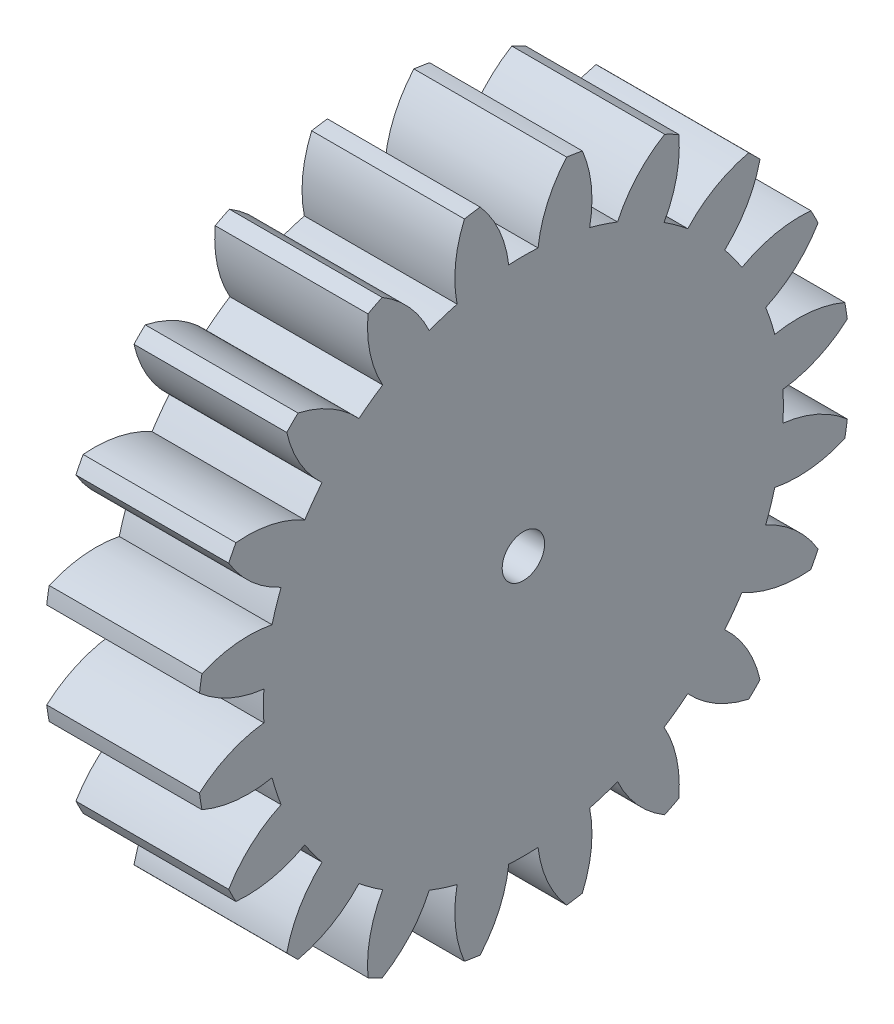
ISO-10303-21;
HEADER;
FILE_DESCRIPTION(('STEP AP214'),'2;1');
FILE_NAME('part.step','',(''),(''),'','','');
FILE_SCHEMA(('AUTOMOTIVE_DESIGN { 1 0 10303 214 1 1 1 1 }'));
ENDSEC;
DATA;
#1=APPLICATION_CONTEXT('core data for automotive mechanical design processes');
#2=APPLICATION_PROTOCOL_DEFINITION('international standard','automotive_design',2000,#1);
#3=PRODUCT_CONTEXT('',#1,'mechanical');
#4=PRODUCT('Part','Part','',(#3));
#5=PRODUCT_RELATED_PRODUCT_CATEGORY('part','',(#4));
#6=PRODUCT_DEFINITION_FORMATION('','',#4);
#7=PRODUCT_DEFINITION_CONTEXT('part definition',#1,'design');
#8=PRODUCT_DEFINITION('design','',#6,#7);
#9=PRODUCT_DEFINITION_SHAPE('','',#8);
#10=(LENGTH_UNIT() NAMED_UNIT(*) SI_UNIT(.MILLI.,.METRE.));
#11=(NAMED_UNIT(*) PLANE_ANGLE_UNIT() SI_UNIT($,.RADIAN.));
#12=(NAMED_UNIT(*) SI_UNIT($,.STERADIAN.) SOLID_ANGLE_UNIT());
#13=UNCERTAINTY_MEASURE_WITH_UNIT(LENGTH_MEASURE(1.E-05),#10,'distance_accuracy_value','');
#14=(GEOMETRIC_REPRESENTATION_CONTEXT(3) GLOBAL_UNCERTAINTY_ASSIGNED_CONTEXT((#13)) GLOBAL_UNIT_ASSIGNED_CONTEXT((#10,
#11,#12)) REPRESENTATION_CONTEXT('',''));
#15=CARTESIAN_POINT('',(0.,0.,0.));
#16=DIRECTION('',(0.,0.,1.));
#17=DIRECTION('',(1.,0.,0.));
#18=AXIS2_PLACEMENT_3D('',#15,#16,#17);
#19=CARTESIAN_POINT('',(18.,0.,0.));
#20=DIRECTION('',(-1.,0.,0.));
#21=DIRECTION('',(0.,0.,1.));
#22=AXIS2_PLACEMENT_3D('',#19,#20,#21);
#23=PLANE('',#22);
#24=CARTESIAN_POINT('',(18.,0.,0.));
#25=DIRECTION('',(-1.,0.,0.));
#26=DIRECTION('',(0.,0.,1.));
#27=AXIS2_PLACEMENT_3D('',#24,#25,#26);
#28=CIRCLE('',#27,2.5);
#29=CARTESIAN_POINT('',(18.,0.,2.5));
#30=VERTEX_POINT('',#29);
#31=EDGE_CURVE('E881',#30,#30,#28,.F.);
#32=ORIENTED_EDGE('',*,*,#31,.F.);
#33=EDGE_LOOP('',(#32));
#34=FACE_BOUND('',#33,.T.);
#35=CARTESIAN_POINT('',(18.,15.6294576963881,28.9382493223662));
#36=DIRECTION('',(-1.,0.,0.));
#37=DIRECTION('',(0.,1.,0.));
#38=AXIS2_PLACEMENT_3D('',#35,#36,#37);
#39=CIRCLE('',#38,14.000000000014);
#40=CARTESIAN_POINT('',(18.,1.72550493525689,30.5753496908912));
#41=VERTEX_POINT('',#40);
#42=CARTESIAN_POINT('',(18.,5.09674034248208,38.161148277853));
#43=VERTEX_POINT('',#42);
#44=EDGE_CURVE('E581',#41,#43,#39,.T.);
#45=ORIENTED_EDGE('',*,*,#44,.F.);
#46=CARTESIAN_POINT('',(18.,0.,0.));
#47=DIRECTION('',(-1.,0.,0.));
#48=DIRECTION('',(0.,1.,0.));
#49=AXIS2_PLACEMENT_3D('',#46,#47,#48);
#50=CIRCLE('',#49,30.6240000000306);
#51=CARTESIAN_POINT('',(18.,-1.7255049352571,30.5753496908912));
#52=VERTEX_POINT('',#51);
#53=EDGE_CURVE('E588',#52,#41,#50,.T.);
#54=ORIENTED_EDGE('',*,*,#53,.F.);
#55=CARTESIAN_POINT('',(18.,-15.6294576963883,28.9382493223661));
#56=DIRECTION('',(-1.,0.,0.));
#57=DIRECTION('',(0.,1.,0.));
#58=AXIS2_PLACEMENT_3D('',#55,#56,#57);
#59=CIRCLE('',#58,14.000000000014);
#60=CARTESIAN_POINT('',(18.,-5.09674034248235,38.1611482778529));
#61=VERTEX_POINT('',#60);
#62=EDGE_CURVE('E584',#61,#52,#59,.T.);
#63=ORIENTED_EDGE('',*,*,#62,.F.);
#64=CARTESIAN_POINT('',(18.,0.,0.));
#65=DIRECTION('',(-1.,0.,0.));
#66=DIRECTION('',(0.,0.,1.));
#67=AXIS2_PLACEMENT_3D('',#64,#65,#66);
#68=CIRCLE('',#67,38.5000000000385);
#69=CARTESIAN_POINT('',(18.,-6.94515522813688,37.868388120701));
#70=VERTEX_POINT('',#69);
#71=EDGE_CURVE('E1346',#70,#61,#68,.T.);
#72=ORIENTED_EDGE('',*,*,#71,.F.);
#73=CARTESIAN_POINT('',(18.,5.92208676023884,32.3516786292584));
#74=DIRECTION('',(-1.,0.,0.));
#75=DIRECTION('',(0.,0.951056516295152,0.309016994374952));
#76=AXIS2_PLACEMENT_3D('',#73,#74,#75);
#77=CIRCLE('',#76,14.000000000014);
#78=CARTESIAN_POINT('',(18.,-7.80724995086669,29.6120959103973));
#79=VERTEX_POINT('',#78);
#80=EDGE_CURVE('E748',#79,#70,#77,.T.);
#81=ORIENTED_EDGE('',*,*,#80,.F.);
#82=CARTESIAN_POINT('',(18.,0.,0.));
#83=DIRECTION('',(-1.,0.,0.));
#84=DIRECTION('',(0.,0.951056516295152,0.309016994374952));
#85=AXIS2_PLACEMENT_3D('',#82,#83,#84);
#86=CIRCLE('',#85,30.6240000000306);
#87=CARTESIAN_POINT('',(18.,-11.0893553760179,28.5456752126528));
#88=VERTEX_POINT('',#87);
#89=EDGE_CURVE('E755',#88,#79,#86,.T.);
#90=ORIENTED_EDGE('',*,*,#89,.F.);
#91=CARTESIAN_POINT('',(18.,-23.8069084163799,22.6921425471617));
#92=DIRECTION('',(-1.,0.,0.));
#93=DIRECTION('',(0.,0.951056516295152,0.309016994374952));
#94=AXIS2_PLACEMENT_3D('',#91,#92,#93);
#95=CIRCLE('',#94,14.000000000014);
#96=CARTESIAN_POINT('',(18.,-16.6397314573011,34.7184293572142));
#97=VERTEX_POINT('',#96);
#98=EDGE_CURVE('E751',#97,#88,#95,.T.);
#99=ORIENTED_EDGE('',*,*,#98,.F.);
#100=CARTESIAN_POINT('',(18.,-18.3072106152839,33.8688062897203));
#101=VERTEX_POINT('',#100);
#102=EDGE_CURVE('E1324',#101,#97,#68,.T.);
#103=ORIENTED_EDGE('',*,*,#102,.F.);
#104=CARTESIAN_POINT('',(18.,-4.36497928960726,32.5983002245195));
#105=DIRECTION('',(-1.,0.,0.));
#106=DIRECTION('',(0.,0.809016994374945,0.587785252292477));
#107=AXIS2_PLACEMENT_3D('',#104,#105,#106);
#108=CIRCLE('',#107,14.000000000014);
#109=CARTESIAN_POINT('',(18.,-16.5757768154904,25.7502038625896));
#110=VERTEX_POINT('',#109);
#111=EDGE_CURVE('E724',#110,#101,#108,.T.);
#112=ORIENTED_EDGE('',*,*,#111,.F.);
#113=CARTESIAN_POINT('',(18.,0.,0.));
#114=DIRECTION('',(-1.,0.,0.));
#115=DIRECTION('',(0.,0.809016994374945,0.587785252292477));
#116=AXIS2_PLACEMENT_3D('',#113,#114,#115);
#117=CIRCLE('',#116,30.6240000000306);
#118=CARTESIAN_POINT('',(18.,-19.3677024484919,23.7217511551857));
#119=VERTEX_POINT('',#118);
#120=EDGE_CURVE('E731',#119,#110,#117,.T.);
#121=ORIENTED_EDGE('',*,*,#120,.F.);
#122=CARTESIAN_POINT('',(18.,-29.6539730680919,14.2247707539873));
#123=DIRECTION('',(-1.,0.,0.));
#124=DIRECTION('',(0.,0.809016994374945,0.587785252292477));
#125=AXIS2_PLACEMENT_3D('',#122,#123,#124);
#126=CIRCLE('',#125,14.000000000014);
#127=CARTESIAN_POINT('',(18.,-26.5539097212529,27.87722867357));
#128=VERTEX_POINT('',#127);
#129=EDGE_CURVE('E727',#128,#119,#126,.T.);
#130=ORIENTED_EDGE('',*,*,#129,.F.);
#131=CARTESIAN_POINT('',(18.,-27.8772286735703,26.5539097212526));
#132=VERTEX_POINT('',#131);
#133=EDGE_CURVE('E1453',#132,#128,#68,.T.);
#134=ORIENTED_EDGE('',*,*,#133,.F.);
#135=CARTESIAN_POINT('',(18.,-14.2247707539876,29.6539730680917));
#136=DIRECTION('',(-1.,0.,0.));
#137=DIRECTION('',(0.,0.587785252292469,0.809016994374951));
#138=AXIS2_PLACEMENT_3D('',#135,#136,#137);
#139=CIRCLE('',#138,14.000000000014);
#140=CARTESIAN_POINT('',(18.,-23.7217511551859,19.3677024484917));
#141=VERTEX_POINT('',#140);
#142=EDGE_CURVE('E700',#141,#132,#139,.T.);
#143=ORIENTED_EDGE('',*,*,#142,.F.);
#144=CARTESIAN_POINT('',(18.,0.,0.));
#145=DIRECTION('',(-1.,0.,0.));
#146=DIRECTION('',(0.,0.587785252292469,0.809016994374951));
#147=AXIS2_PLACEMENT_3D('',#144,#145,#146);
#148=CIRCLE('',#147,30.6240000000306);
#149=CARTESIAN_POINT('',(18.,-25.7502038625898,16.5757768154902));
#150=VERTEX_POINT('',#149);
#151=EDGE_CURVE('E707',#150,#141,#148,.T.);
#152=ORIENTED_EDGE('',*,*,#151,.F.);
#153=CARTESIAN_POINT('',(18.,-32.5983002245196,4.36497928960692));
#154=DIRECTION('',(-1.,0.,0.));
#155=DIRECTION('',(0.,0.587785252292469,0.809016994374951));
#156=AXIS2_PLACEMENT_3D('',#153,#154,#155);
#157=CIRCLE('',#156,14.000000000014);
#158=CARTESIAN_POINT('',(18.,-33.8688062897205,18.3072106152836));
#159=VERTEX_POINT('',#158);
#160=EDGE_CURVE('E703',#159,#150,#157,.T.);
#161=ORIENTED_EDGE('',*,*,#160,.F.);
#162=CARTESIAN_POINT('',(18.,-34.7184293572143,16.6397314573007));
#163=VERTEX_POINT('',#162);
#164=EDGE_CURVE('E1446',#163,#159,#68,.T.);
#165=ORIENTED_EDGE('',*,*,#164,.F.);
#166=CARTESIAN_POINT('',(18.,-22.692142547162,23.8069084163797));
#167=DIRECTION('',(-1.,0.,0.));
#168=DIRECTION('',(0.,0.309016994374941,0.951056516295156));
#169=AXIS2_PLACEMENT_3D('',#166,#167,#168);
#170=CIRCLE('',#169,14.000000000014);
#171=CARTESIAN_POINT('',(18.,-28.5456752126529,11.0893553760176));
#172=VERTEX_POINT('',#171);
#173=EDGE_CURVE('E650',#172,#163,#170,.T.);
#174=ORIENTED_EDGE('',*,*,#173,.F.);
#175=CARTESIAN_POINT('',(18.,0.,0.));
#176=DIRECTION('',(-1.,0.,0.));
#177=DIRECTION('',(0.,0.309016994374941,0.951056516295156));
#178=AXIS2_PLACEMENT_3D('',#175,#176,#177);
#179=CIRCLE('',#178,30.6240000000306);
#180=CARTESIAN_POINT('',(18.,-29.6120959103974,7.80724995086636));
#181=VERTEX_POINT('',#180);
#182=EDGE_CURVE('E657',#181,#172,#179,.T.);
#183=ORIENTED_EDGE('',*,*,#182,.F.);
#184=CARTESIAN_POINT('',(18.,-32.3516786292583,-5.92208676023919));
#185=DIRECTION('',(-1.,0.,0.));
#186=DIRECTION('',(0.,0.309016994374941,0.951056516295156));
#187=AXIS2_PLACEMENT_3D('',#184,#185,#186);
#188=CIRCLE('',#187,14.000000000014);
#189=CARTESIAN_POINT('',(18.,-37.8683881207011,6.94515522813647));
#190=VERTEX_POINT('',#189);
#191=EDGE_CURVE('E653',#190,#181,#188,.T.);
#192=ORIENTED_EDGE('',*,*,#191,.F.);
#193=CARTESIAN_POINT('',(18.,-38.161148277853,5.09674034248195));
#194=VERTEX_POINT('',#193);
#195=EDGE_CURVE('E1439',#194,#190,#68,.T.);
#196=ORIENTED_EDGE('',*,*,#195,.F.);
#197=CARTESIAN_POINT('',(18.,-28.9382493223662,15.629457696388));
#198=DIRECTION('',(-1.,0.,0.));
#199=DIRECTION('',(0.,0.,1.));
#200=AXIS2_PLACEMENT_3D('',#197,#198,#199);
#201=CIRCLE('',#200,14.000000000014);
#202=CARTESIAN_POINT('',(18.,-30.5753496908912,1.72550493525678));
#203=VERTEX_POINT('',#202);
#204=EDGE_CURVE('E676',#203,#194,#201,.T.);
#205=ORIENTED_EDGE('',*,*,#204,.F.);
#206=CARTESIAN_POINT('',(18.,0.,0.));
#207=DIRECTION('',(-1.,0.,0.));
#208=DIRECTION('',(0.,0.,1.));
#209=AXIS2_PLACEMENT_3D('',#206,#207,#208);
#210=CIRCLE('',#209,30.6240000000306);
#211=CARTESIAN_POINT('',(18.,-30.5753496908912,-1.72550493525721));
#212=VERTEX_POINT('',#211);
#213=EDGE_CURVE('E683',#212,#203,#210,.T.);
#214=ORIENTED_EDGE('',*,*,#213,.F.);
#215=CARTESIAN_POINT('',(18.,-28.938249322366,-15.6294576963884));
#216=DIRECTION('',(-1.,0.,0.));
#217=DIRECTION('',(0.,0.,1.));
#218=AXIS2_PLACEMENT_3D('',#215,#216,#217);
#219=CIRCLE('',#218,14.000000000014);
#220=CARTESIAN_POINT('',(18.,-38.1611482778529,-5.09674034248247));
#221=VERTEX_POINT('',#220);
#222=EDGE_CURVE('E679',#221,#212,#219,.T.);
#223=ORIENTED_EDGE('',*,*,#222,.F.);
#224=CARTESIAN_POINT('',(18.,-37.868388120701,-6.94515522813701));
#225=VERTEX_POINT('',#224);
#226=EDGE_CURVE('E1432',#225,#221,#68,.T.);
#227=ORIENTED_EDGE('',*,*,#226,.F.);
#228=CARTESIAN_POINT('',(18.,-32.3516786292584,5.92208676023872));
#229=DIRECTION('',(-1.,0.,0.));
#230=DIRECTION('',(0.,-0.309016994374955,0.951056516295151));
#231=AXIS2_PLACEMENT_3D('',#228,#229,#230);
#232=CIRCLE('',#231,14.000000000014);
#233=CARTESIAN_POINT('',(18.,-29.6120959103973,-7.80724995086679));
#234=VERTEX_POINT('',#233);
#235=EDGE_CURVE('E844',#234,#225,#232,.T.);
#236=ORIENTED_EDGE('',*,*,#235,.F.);
#237=CARTESIAN_POINT('',(18.,0.,0.));
#238=DIRECTION('',(-1.,0.,0.));
#239=DIRECTION('',(0.,-0.309016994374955,0.951056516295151));
#240=AXIS2_PLACEMENT_3D('',#237,#238,#239);
#241=CIRCLE('',#240,30.6240000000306);
#242=CARTESIAN_POINT('',(18.,-28.5456752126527,-11.089355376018));
#243=VERTEX_POINT('',#242);
#244=EDGE_CURVE('E851',#243,#234,#241,.T.);
#245=ORIENTED_EDGE('',*,*,#244,.F.);
#246=CARTESIAN_POINT('',(18.,-22.6921425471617,-23.80690841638));
#247=DIRECTION('',(-1.,0.,0.));
#248=DIRECTION('',(0.,-0.309016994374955,0.951056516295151));
#249=AXIS2_PLACEMENT_3D('',#246,#247,#248);
#250=CIRCLE('',#249,14.000000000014);
#251=CARTESIAN_POINT('',(18.,-34.7184293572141,-16.6397314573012));
#252=VERTEX_POINT('',#251);
#253=EDGE_CURVE('E847',#252,#243,#250,.T.);
#254=ORIENTED_EDGE('',*,*,#253,.F.);
#255=CARTESIAN_POINT('',(18.,-33.8688062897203,-18.3072106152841));
#256=VERTEX_POINT('',#255);
#257=EDGE_CURVE('E1425',#256,#252,#68,.T.);
#258=ORIENTED_EDGE('',*,*,#257,.F.);
#259=CARTESIAN_POINT('',(18.,-32.5983002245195,-4.36497928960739));
#260=DIRECTION('',(-1.,0.,0.));
#261=DIRECTION('',(0.,-0.58778525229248,0.809016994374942));
#262=AXIS2_PLACEMENT_3D('',#259,#260,#261);
#263=CIRCLE('',#262,14.000000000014);
#264=CARTESIAN_POINT('',(18.,-25.7502038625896,-16.5757768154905));
#265=VERTEX_POINT('',#264);
#266=EDGE_CURVE('E820',#265,#256,#263,.T.);
#267=ORIENTED_EDGE('',*,*,#266,.F.);
#268=CARTESIAN_POINT('',(18.,0.,0.));
#269=DIRECTION('',(-1.,0.,0.));
#270=DIRECTION('',(0.,-0.58778525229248,0.809016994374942));
#271=AXIS2_PLACEMENT_3D('',#268,#269,#270);
#272=CIRCLE('',#271,30.6240000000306);
#273=CARTESIAN_POINT('',(18.,-23.7217511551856,-19.367702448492));
#274=VERTEX_POINT('',#273);
#275=EDGE_CURVE('E827',#274,#265,#272,.T.);
#276=ORIENTED_EDGE('',*,*,#275,.F.);
#277=CARTESIAN_POINT('',(18.,-14.2247707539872,-29.6539730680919));
#278=DIRECTION('',(-1.,0.,0.));
#279=DIRECTION('',(0.,-0.58778525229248,0.809016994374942));
#280=AXIS2_PLACEMENT_3D('',#277,#278,#279);
#281=CIRCLE('',#280,14.000000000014);
#282=CARTESIAN_POINT('',(18.,-27.8772286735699,-26.553909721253));
#283=VERTEX_POINT('',#282);
#284=EDGE_CURVE('E823',#283,#274,#281,.T.);
#285=ORIENTED_EDGE('',*,*,#284,.F.);
#286=CARTESIAN_POINT('',(18.,-26.5539097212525,-27.8772286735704));
#287=VERTEX_POINT('',#286);
#288=EDGE_CURVE('E1418',#287,#283,#68,.T.);
#289=ORIENTED_EDGE('',*,*,#288,.F.);
#290=CARTESIAN_POINT('',(18.,-29.6539730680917,-14.2247707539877));
#291=DIRECTION('',(-1.,0.,0.));
#292=DIRECTION('',(0.,-0.809016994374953,0.587785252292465));
#293=AXIS2_PLACEMENT_3D('',#290,#291,#292);
#294=CIRCLE('',#293,14.000000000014);
#295=CARTESIAN_POINT('',(18.,-19.3677024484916,-23.721751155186));
#296=VERTEX_POINT('',#295);
#297=EDGE_CURVE('E796',#296,#287,#294,.T.);
#298=ORIENTED_EDGE('',*,*,#297,.F.);
#299=CARTESIAN_POINT('',(18.,0.,0.));
#300=DIRECTION('',(-1.,0.,0.));
#301=DIRECTION('',(0.,-0.809016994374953,0.587785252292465));
#302=AXIS2_PLACEMENT_3D('',#299,#300,#301);
#303=CIRCLE('',#302,30.6240000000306);
#304=CARTESIAN_POINT('',(18.,-16.5757768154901,-25.7502038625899));
#305=VERTEX_POINT('',#304);
#306=EDGE_CURVE('E803',#305,#296,#303,.T.);
#307=ORIENTED_EDGE('',*,*,#306,.F.);
#308=CARTESIAN_POINT('',(18.,-4.36497928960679,-32.5983002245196));
#309=DIRECTION('',(-1.,0.,0.));
#310=DIRECTION('',(0.,-0.809016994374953,0.587785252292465));
#311=AXIS2_PLACEMENT_3D('',#308,#309,#310);
#312=CIRCLE('',#311,14.000000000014);
#313=CARTESIAN_POINT('',(18.,-18.3072106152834,-33.8688062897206));
#314=VERTEX_POINT('',#313);
#315=EDGE_CURVE('E799',#314,#305,#312,.T.);
#316=ORIENTED_EDGE('',*,*,#315,.F.);
#317=CARTESIAN_POINT('',(18.,-16.6397314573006,-34.7184293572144));
#318=VERTEX_POINT('',#317);
#319=EDGE_CURVE('E1411',#318,#314,#68,.T.);
#320=ORIENTED_EDGE('',*,*,#319,.F.);
#321=CARTESIAN_POINT('',(18.,-23.8069084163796,-22.6921425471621));
#322=DIRECTION('',(-1.,0.,0.));
#323=DIRECTION('',(0.,-0.951056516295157,0.309016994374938));
#324=AXIS2_PLACEMENT_3D('',#321,#322,#323);
#325=CIRCLE('',#324,14.000000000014);
#326=CARTESIAN_POINT('',(18.,-11.0893553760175,-28.5456752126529));
#327=VERTEX_POINT('',#326);
#328=EDGE_CURVE('E770',#327,#318,#325,.T.);
#329=ORIENTED_EDGE('',*,*,#328,.F.);
#330=CARTESIAN_POINT('',(18.,0.,0.));
#331=DIRECTION('',(-1.,0.,0.));
#332=DIRECTION('',(0.,-0.951056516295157,0.309016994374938));
#333=AXIS2_PLACEMENT_3D('',#330,#331,#332);
#334=CIRCLE('',#333,30.6240000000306);
#335=CARTESIAN_POINT('',(18.,-7.80724995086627,-29.6120959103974));
#336=VERTEX_POINT('',#335);
#337=EDGE_CURVE('E777',#336,#327,#334,.T.);
#338=ORIENTED_EDGE('',*,*,#337,.F.);
#339=CARTESIAN_POINT('',(18.,5.92208676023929,-32.3516786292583));
#340=DIRECTION('',(-1.,0.,0.));
#341=DIRECTION('',(0.,-0.951056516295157,0.309016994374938));
#342=AXIS2_PLACEMENT_3D('',#339,#340,#341);
#343=CIRCLE('',#342,14.000000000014);
#344=CARTESIAN_POINT('',(18.,-6.94515522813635,-37.8683881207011));
#345=VERTEX_POINT('',#344);
#346=EDGE_CURVE('E773',#345,#336,#343,.T.);
#347=ORIENTED_EDGE('',*,*,#346,.F.);
#348=CARTESIAN_POINT('',(18.,-5.09674034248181,-38.161148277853));
#349=VERTEX_POINT('',#348);
#350=EDGE_CURVE('E1404',#349,#345,#68,.T.);
#351=ORIENTED_EDGE('',*,*,#350,.F.);
#352=CARTESIAN_POINT('',(18.,-15.6294576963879,-28.9382493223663));
#353=DIRECTION('',(-1.,0.,0.));
#354=DIRECTION('',(0.,-1.,0.));
#355=AXIS2_PLACEMENT_3D('',#352,#353,#354);
#356=CIRCLE('',#355,14.000000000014);
#357=CARTESIAN_POINT('',(18.,-1.72550493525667,-30.5753496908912));
#358=VERTEX_POINT('',#357);
#359=EDGE_CURVE('E940',#358,#349,#356,.T.);
#360=ORIENTED_EDGE('',*,*,#359,.F.);
#361=CARTESIAN_POINT('',(18.,0.,0.));
#362=DIRECTION('',(-1.,0.,0.));
#363=DIRECTION('',(0.,-1.,0.));
#364=AXIS2_PLACEMENT_3D('',#361,#362,#363);
#365=CIRCLE('',#364,30.6240000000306);
#366=CARTESIAN_POINT('',(18.,1.72550493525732,-30.5753496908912));
#367=VERTEX_POINT('',#366);
#368=EDGE_CURVE('E947',#367,#358,#365,.T.);
#369=ORIENTED_EDGE('',*,*,#368,.F.);
#370=CARTESIAN_POINT('',(18.,15.6294576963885,-28.9382493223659));
#371=DIRECTION('',(-1.,0.,0.));
#372=DIRECTION('',(0.,-1.,0.));
#373=AXIS2_PLACEMENT_3D('',#370,#371,#372);
#374=CIRCLE('',#373,14.000000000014);
#375=CARTESIAN_POINT('',(18.,5.09674034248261,-38.1611482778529));
#376=VERTEX_POINT('',#375);
#377=EDGE_CURVE('E943',#376,#367,#374,.T.);
#378=ORIENTED_EDGE('',*,*,#377,.F.);
#379=CARTESIAN_POINT('',(18.,6.94515522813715,-37.8683881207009));
#380=VERTEX_POINT('',#379);
#381=EDGE_CURVE('E1397',#380,#376,#68,.T.);
#382=ORIENTED_EDGE('',*,*,#381,.F.);
#383=CARTESIAN_POINT('',(18.,-5.92208676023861,-32.3516786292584));
#384=DIRECTION('',(-1.,0.,0.));
#385=DIRECTION('',(0.,-0.95105651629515,-0.309016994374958));
#386=AXIS2_PLACEMENT_3D('',#383,#384,#385);
#387=CIRCLE('',#386,14.000000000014);
#388=CARTESIAN_POINT('',(18.,7.80724995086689,-29.6120959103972));
#389=VERTEX_POINT('',#388);
#390=EDGE_CURVE('E964',#389,#380,#387,.T.);
#391=ORIENTED_EDGE('',*,*,#390,.F.);
#392=CARTESIAN_POINT('',(18.,0.,0.));
#393=DIRECTION('',(-1.,0.,0.));
#394=DIRECTION('',(0.,-0.95105651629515,-0.309016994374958));
#395=AXIS2_PLACEMENT_3D('',#392,#393,#394);
#396=CIRCLE('',#395,30.6240000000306);
#397=CARTESIAN_POINT('',(18.,11.0893553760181,-28.5456752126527));
#398=VERTEX_POINT('',#397);
#399=EDGE_CURVE('E971',#398,#389,#396,.T.);
#400=ORIENTED_EDGE('',*,*,#399,.F.);
#401=CARTESIAN_POINT('',(18.,23.8069084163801,-22.6921425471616));
#402=DIRECTION('',(-1.,0.,0.));
#403=DIRECTION('',(0.,-0.95105651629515,-0.309016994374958));
#404=AXIS2_PLACEMENT_3D('',#401,#402,#403);
#405=CIRCLE('',#404,14.000000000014);
#406=CARTESIAN_POINT('',(18.,16.6397314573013,-34.718429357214));
#407=VERTEX_POINT('',#406);
#408=EDGE_CURVE('E967',#407,#398,#405,.T.);
#409=ORIENTED_EDGE('',*,*,#408,.F.);
#410=CARTESIAN_POINT('',(18.,18.3072106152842,-33.8688062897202));
#411=VERTEX_POINT('',#410);
#412=EDGE_CURVE('E1390',#411,#407,#68,.T.);
#413=ORIENTED_EDGE('',*,*,#412,.F.);
#414=CARTESIAN_POINT('',(18.,4.3649792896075,-32.5983002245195));
#415=DIRECTION('',(-1.,0.,0.));
#416=DIRECTION('',(0.,-0.80901699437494,-0.587785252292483));
#417=AXIS2_PLACEMENT_3D('',#414,#415,#416);
#418=CIRCLE('',#417,14.000000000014);
#419=CARTESIAN_POINT('',(18.,16.5757768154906,-25.7502038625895));
#420=VERTEX_POINT('',#419);
#421=EDGE_CURVE('E916',#420,#411,#418,.T.);
#422=ORIENTED_EDGE('',*,*,#421,.F.);
#423=CARTESIAN_POINT('',(18.,0.,0.));
#424=DIRECTION('',(-1.,0.,0.));
#425=DIRECTION('',(0.,-0.80901699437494,-0.587785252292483));
#426=AXIS2_PLACEMENT_3D('',#423,#424,#425);
#427=CIRCLE('',#426,30.6240000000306);
#428=CARTESIAN_POINT('',(18.,19.3677024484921,-23.7217511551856));
#429=VERTEX_POINT('',#428);
#430=EDGE_CURVE('E923',#429,#420,#427,.T.);
#431=ORIENTED_EDGE('',*,*,#430,.F.);
#432=CARTESIAN_POINT('',(18.,29.653973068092,-14.2247707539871));
#433=DIRECTION('',(-1.,0.,0.));
#434=DIRECTION('',(0.,-0.80901699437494,-0.587785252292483));
#435=AXIS2_PLACEMENT_3D('',#432,#433,#434);
#436=CIRCLE('',#435,14.000000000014);
#437=CARTESIAN_POINT('',(18.,26.5539097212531,-27.8772286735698));
#438=VERTEX_POINT('',#437);
#439=EDGE_CURVE('E919',#438,#429,#436,.T.);
#440=ORIENTED_EDGE('',*,*,#439,.F.);
#441=CARTESIAN_POINT('',(18.,27.8772286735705,-26.5539097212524));
#442=VERTEX_POINT('',#441);
#443=EDGE_CURVE('E1383',#442,#438,#68,.T.);
#444=ORIENTED_EDGE('',*,*,#443,.F.);
#445=CARTESIAN_POINT('',(18.,14.2247707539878,-29.6539730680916));
#446=DIRECTION('',(-1.,0.,0.));
#447=DIRECTION('',(0.,-0.587785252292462,-0.809016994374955));
#448=AXIS2_PLACEMENT_3D('',#445,#446,#447);
#449=CIRCLE('',#448,14.000000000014);
#450=CARTESIAN_POINT('',(18.,23.7217511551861,-19.3677024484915));
#451=VERTEX_POINT('',#450);
#452=EDGE_CURVE('E892',#451,#442,#449,.T.);
#453=ORIENTED_EDGE('',*,*,#452,.F.);
#454=CARTESIAN_POINT('',(18.,0.,0.));
#455=DIRECTION('',(-1.,0.,0.));
#456=DIRECTION('',(0.,-0.587785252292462,-0.809016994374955));
#457=AXIS2_PLACEMENT_3D('',#454,#455,#456);
#458=CIRCLE('',#457,30.6240000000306);
#459=CARTESIAN_POINT('',(18.,25.7502038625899,-16.57577681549));
#460=VERTEX_POINT('',#459);
#461=EDGE_CURVE('E899',#460,#451,#458,.T.);
#462=ORIENTED_EDGE('',*,*,#461,.F.);
#463=CARTESIAN_POINT('',(18.,32.5983002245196,-4.36497928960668));
#464=DIRECTION('',(-1.,0.,0.));
#465=DIRECTION('',(0.,-0.587785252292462,-0.809016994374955));
#466=AXIS2_PLACEMENT_3D('',#463,#464,#465);
#467=CIRCLE('',#466,14.000000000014);
#468=CARTESIAN_POINT('',(18.,33.8688062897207,-18.3072106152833));
#469=VERTEX_POINT('',#468);
#470=EDGE_CURVE('E895',#469,#460,#467,.T.);
#471=ORIENTED_EDGE('',*,*,#470,.F.);
#472=CARTESIAN_POINT('',(18.,34.7184293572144,-16.6397314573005));
#473=VERTEX_POINT('',#472);
#474=EDGE_CURVE('E1167',#473,#469,#68,.T.);
#475=ORIENTED_EDGE('',*,*,#474,.F.);
#476=CARTESIAN_POINT('',(18.,22.6921425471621,-23.8069084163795));
#477=DIRECTION('',(-1.,0.,0.));
#478=DIRECTION('',(0.,-0.309016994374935,-0.951056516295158));
#479=AXIS2_PLACEMENT_3D('',#476,#477,#478);
#480=CIRCLE('',#479,14.000000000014);
#481=CARTESIAN_POINT('',(18.,28.545675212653,-11.0893553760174));
#482=VERTEX_POINT('',#481);
#483=EDGE_CURVE('E866',#482,#473,#480,.T.);
#484=ORIENTED_EDGE('',*,*,#483,.F.);
#485=CARTESIAN_POINT('',(18.,0.,0.));
#486=DIRECTION('',(-1.,0.,0.));
#487=DIRECTION('',(0.,-0.309016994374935,-0.951056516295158));
#488=AXIS2_PLACEMENT_3D('',#485,#486,#487);
#489=CIRCLE('',#488,30.6240000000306);
#490=CARTESIAN_POINT('',(18.,29.6120959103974,-7.80724995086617));
#491=VERTEX_POINT('',#490);
#492=EDGE_CURVE('E873',#491,#482,#489,.T.);
#493=ORIENTED_EDGE('',*,*,#492,.F.);
#494=CARTESIAN_POINT('',(18.,32.3516786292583,5.9220867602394));
#495=DIRECTION('',(-1.,0.,0.));
#496=DIRECTION('',(0.,-0.309016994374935,-0.951056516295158));
#497=AXIS2_PLACEMENT_3D('',#494,#495,#496);
#498=CIRCLE('',#497,14.000000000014);
#499=CARTESIAN_POINT('',(18.,37.8683881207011,-6.94515522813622));
#500=VERTEX_POINT('',#499);
#501=EDGE_CURVE('E869',#500,#491,#498,.T.);
#502=ORIENTED_EDGE('',*,*,#501,.F.);
#503=CARTESIAN_POINT('',(18.,38.161148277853,-5.09674034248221));
#504=VERTEX_POINT('',#503);
#505=EDGE_CURVE('E1162',#504,#500,#68,.T.);
#506=ORIENTED_EDGE('',*,*,#505,.F.);
#507=CARTESIAN_POINT('',(18.,28.9382493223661,-15.6294576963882));
#508=DIRECTION('',(-1.,0.,0.));
#509=DIRECTION('',(0.,0.,-1.));
#510=AXIS2_PLACEMENT_3D('',#507,#508,#509);
#511=CIRCLE('',#510,14.000000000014);
#512=CARTESIAN_POINT('',(18.,30.5753496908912,-1.72550493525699));
#513=VERTEX_POINT('',#512);
#514=EDGE_CURVE('E1124',#513,#504,#511,.T.);
#515=ORIENTED_EDGE('',*,*,#514,.F.);
#516=CARTESIAN_POINT('',(18.,0.,0.));
#517=DIRECTION('',(-1.,0.,0.));
#518=DIRECTION('',(0.,0.,-1.));
#519=AXIS2_PLACEMENT_3D('',#516,#517,#518);
#520=CIRCLE('',#519,30.6240000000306);
#521=CARTESIAN_POINT('',(18.,30.5753496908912,1.725504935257));
#522=VERTEX_POINT('',#521);
#523=EDGE_CURVE('E1131',#522,#513,#520,.T.);
#524=ORIENTED_EDGE('',*,*,#523,.F.);
#525=CARTESIAN_POINT('',(18.,28.9382493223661,15.6294576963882));
#526=DIRECTION('',(-1.,0.,0.));
#527=DIRECTION('',(0.,0.,-1.));
#528=AXIS2_PLACEMENT_3D('',#525,#526,#527);
#529=CIRCLE('',#528,14.000000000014);
#530=CARTESIAN_POINT('',(18.,38.161148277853,5.09674034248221));
#531=VERTEX_POINT('',#530);
#532=EDGE_CURVE('E1127',#531,#522,#529,.T.);
#533=ORIENTED_EDGE('',*,*,#532,.F.);
#534=CARTESIAN_POINT('',(18.,37.868388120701,6.94515522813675));
#535=VERTEX_POINT('',#534);
#536=EDGE_CURVE('E1159',#535,#531,#68,.T.);
#537=ORIENTED_EDGE('',*,*,#536,.F.);
#538=CARTESIAN_POINT('',(18.,32.3516786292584,-5.92208676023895));
#539=DIRECTION('',(-1.,0.,0.));
#540=DIRECTION('',(0.,0.309016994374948,-0.951056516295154));
#541=AXIS2_PLACEMENT_3D('',#538,#539,#540);
#542=CIRCLE('',#541,14.000000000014);
#543=CARTESIAN_POINT('',(18.,29.6120959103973,7.80724995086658));
#544=VERTEX_POINT('',#543);
#545=EDGE_CURVE('E1093',#544,#535,#542,.T.);
#546=ORIENTED_EDGE('',*,*,#545,.F.);
#547=CARTESIAN_POINT('',(18.,0.,0.));
#548=DIRECTION('',(-1.,0.,0.));
#549=DIRECTION('',(0.,0.309016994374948,-0.951056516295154));
#550=AXIS2_PLACEMENT_3D('',#547,#548,#549);
#551=CIRCLE('',#550,30.6240000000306);
#552=CARTESIAN_POINT('',(18.,28.5456752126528,11.0893553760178));
#553=VERTEX_POINT('',#552);
#554=EDGE_CURVE('E1100',#553,#544,#551,.T.);
#555=ORIENTED_EDGE('',*,*,#554,.F.);
#556=CARTESIAN_POINT('',(18.,22.6921425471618,23.8069084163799));
#557=DIRECTION('',(-1.,0.,0.));
#558=DIRECTION('',(0.,0.309016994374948,-0.951056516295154));
#559=AXIS2_PLACEMENT_3D('',#556,#557,#558);
#560=CIRCLE('',#559,14.000000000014);
#561=CARTESIAN_POINT('',(18.,34.7184293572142,16.6397314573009));
#562=VERTEX_POINT('',#561);
#563=EDGE_CURVE('E1096',#562,#553,#560,.T.);
#564=ORIENTED_EDGE('',*,*,#563,.F.);
#565=CARTESIAN_POINT('',(18.,33.8688062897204,18.3072106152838));
#566=VERTEX_POINT('',#565);
#567=EDGE_CURVE('E1168',#566,#562,#68,.T.);
#568=ORIENTED_EDGE('',*,*,#567,.F.);
#569=CARTESIAN_POINT('',(18.,32.5983002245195,4.36497928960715));
#570=DIRECTION('',(-1.,0.,0.));
#571=DIRECTION('',(0.,0.587785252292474,-0.809016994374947));
#572=AXIS2_PLACEMENT_3D('',#569,#570,#571);
#573=CIRCLE('',#572,14.000000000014);
#574=CARTESIAN_POINT('',(18.,25.7502038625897,16.5757768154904));
#575=VERTEX_POINT('',#574);
#576=EDGE_CURVE('E626',#575,#566,#573,.T.);
#577=ORIENTED_EDGE('',*,*,#576,.F.);
#578=CARTESIAN_POINT('',(18.,0.,0.));
#579=DIRECTION('',(-1.,0.,0.));
#580=DIRECTION('',(0.,0.587785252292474,-0.809016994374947));
#581=AXIS2_PLACEMENT_3D('',#578,#579,#580);
#582=CIRCLE('',#581,30.6240000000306);
#583=CARTESIAN_POINT('',(18.,23.7217511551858,19.3677024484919));
#584=VERTEX_POINT('',#583);
#585=EDGE_CURVE('E633',#584,#575,#582,.T.);
#586=ORIENTED_EDGE('',*,*,#585,.F.);
#587=CARTESIAN_POINT('',(18.,14.2247707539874,29.6539730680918));
#588=DIRECTION('',(-1.,0.,0.));
#589=DIRECTION('',(0.,0.587785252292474,-0.809016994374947));
#590=AXIS2_PLACEMENT_3D('',#587,#588,#589);
#591=CIRCLE('',#590,14.000000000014);
#592=CARTESIAN_POINT('',(18.,27.8772286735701,26.5539097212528));
#593=VERTEX_POINT('',#592);
#594=EDGE_CURVE('E629',#593,#584,#591,.T.);
#595=ORIENTED_EDGE('',*,*,#594,.F.);
#596=CARTESIAN_POINT('',(18.,26.5539097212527,27.8772286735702));
#597=VERTEX_POINT('',#596);
#598=EDGE_CURVE('E1361',#597,#593,#68,.T.);
#599=ORIENTED_EDGE('',*,*,#598,.F.);
#600=CARTESIAN_POINT('',(18.,29.6539730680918,14.2247707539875));
#601=DIRECTION('',(-1.,0.,0.));
#602=DIRECTION('',(0.,0.809016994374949,-0.587785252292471));
#603=AXIS2_PLACEMENT_3D('',#600,#601,#602);
#604=CIRCLE('',#603,14.000000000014);
#605=CARTESIAN_POINT('',(18.,19.3677024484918,23.7217511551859));
#606=VERTEX_POINT('',#605);
#607=EDGE_CURVE('E602',#606,#597,#604,.T.);
#608=ORIENTED_EDGE('',*,*,#607,.F.);
#609=CARTESIAN_POINT('',(18.,0.,0.));
#610=DIRECTION('',(-1.,0.,0.));
#611=DIRECTION('',(0.,0.809016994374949,-0.587785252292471));
#612=AXIS2_PLACEMENT_3D('',#609,#610,#611);
#613=CIRCLE('',#612,30.6240000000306);
#614=CARTESIAN_POINT('',(18.,16.5757768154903,25.7502038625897));
#615=VERTEX_POINT('',#614);
#616=EDGE_CURVE('E609',#615,#606,#613,.T.);
#617=ORIENTED_EDGE('',*,*,#616,.F.);
#618=CARTESIAN_POINT('',(18.,4.36497928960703,32.5983002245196));
#619=DIRECTION('',(-1.,0.,0.));
#620=DIRECTION('',(0.,0.809016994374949,-0.587785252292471));
#621=AXIS2_PLACEMENT_3D('',#618,#619,#620);
#622=CIRCLE('',#621,14.000000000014);
#623=CARTESIAN_POINT('',(18.,18.3072106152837,33.8688062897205));
#624=VERTEX_POINT('',#623);
#625=EDGE_CURVE('E605',#624,#615,#622,.T.);
#626=ORIENTED_EDGE('',*,*,#625,.F.);
#627=CARTESIAN_POINT('',(18.,16.6397314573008,34.7184293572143));
#628=VERTEX_POINT('',#627);
#629=EDGE_CURVE('E1357',#628,#624,#68,.T.);
#630=ORIENTED_EDGE('',*,*,#629,.F.);
#631=CARTESIAN_POINT('',(18.,23.8069084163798,22.6921425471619));
#632=DIRECTION('',(-1.,0.,0.));
#633=DIRECTION('',(0.,0.951056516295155,-0.309016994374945));
#634=AXIS2_PLACEMENT_3D('',#631,#632,#633);
#635=CIRCLE('',#634,14.000000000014);
#636=CARTESIAN_POINT('',(18.,11.0893553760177,28.5456752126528));
#637=VERTEX_POINT('',#636);
#638=EDGE_CURVE('E556',#637,#628,#635,.T.);
#639=ORIENTED_EDGE('',*,*,#638,.F.);
#640=CARTESIAN_POINT('',(18.,0.,0.));
#641=DIRECTION('',(-1.,0.,0.));
#642=DIRECTION('',(0.,0.951056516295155,-0.309016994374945));
#643=AXIS2_PLACEMENT_3D('',#640,#641,#642);
#644=CIRCLE('',#643,30.6240000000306);
#645=CARTESIAN_POINT('',(18.,7.80724995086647,29.6120959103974));
#646=VERTEX_POINT('',#645);
#647=EDGE_CURVE('E555',#646,#637,#644,.T.);
#648=ORIENTED_EDGE('',*,*,#647,.F.);
#649=CARTESIAN_POINT('',(18.,-5.92208676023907,32.3516786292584));
#650=DIRECTION('',(-1.,0.,0.));
#651=DIRECTION('',(0.,0.951056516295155,-0.309016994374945));
#652=AXIS2_PLACEMENT_3D('',#649,#650,#651);
#653=CIRCLE('',#652,14.000000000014);
#654=CARTESIAN_POINT('',(18.,6.94515522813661,37.868388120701));
#655=VERTEX_POINT('',#654);
#656=EDGE_CURVE('E543',#655,#646,#653,.T.);
#657=ORIENTED_EDGE('',*,*,#656,.F.);
#658=EDGE_CURVE('E1232',#43,#655,#68,.T.);
#659=ORIENTED_EDGE('',*,*,#658,.F.);
#660=EDGE_LOOP('',(#45,#54,#63,#72,#81,#90,#99,#103,#112,#121,#130,#134,#143,#152,#161,#165,
#174,#183,#192,#196,#205,#214,#223,#227,#236,#245,#254,#258,#267,#276,#285,#289,#298,#307,#316,
#320,#329,#338,#347,#351,#360,#369,#378,#382,#391,#400,#409,#413,#422,#431,#440,#444,#453,#462,
#471,#475,#484,#493,#502,#506,#515,#524,#533,#537,#546,#555,#564,#568,#577,#586,#595,#599,#608,
#617,#626,#630,#639,#648,#657,#659));
#661=FACE_BOUND('',#660,.T.);
#662=ADVANCED_FACE('F45',(#34,#661),#23,.F.);
#663=CARTESIAN_POINT('',(-10.,0.,0.));
#664=DIRECTION('',(-1.,0.,0.));
#665=DIRECTION('',(0.,0.,1.));
#666=AXIS2_PLACEMENT_3D('',#663,#664,#665);
#667=CYLINDRICAL_SURFACE('',#666,38.5000000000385);
#668=DIRECTION('',(-1.,0.,0.));
#669=VECTOR('',#668,1.);
#670=CARTESIAN_POINT('',(9.,5.09674034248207,38.161148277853));
#671=LINE('',#670,#669);
#672=CARTESIAN_POINT('',(0.,5.09674034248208,38.161148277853));
#673=VERTEX_POINT('',#672);
#674=EDGE_CURVE('E1089',#43,#673,#671,.T.);
#675=ORIENTED_EDGE('',*,*,#674,.F.);
#676=ORIENTED_EDGE('',*,*,#658,.T.);
#677=DIRECTION('',(-1.,0.,0.));
#678=VECTOR('',#677,1.);
#679=CARTESIAN_POINT('',(9.,6.94515522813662,37.868388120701));
#680=LINE('',#679,#678);
#681=CARTESIAN_POINT('',(0.,6.94515522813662,37.868388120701));
#682=VERTEX_POINT('',#681);
#683=EDGE_CURVE('E549',#682,#655,#680,.F.);
#684=ORIENTED_EDGE('',*,*,#683,.F.);
#685=CARTESIAN_POINT('',(0.,0.,0.));
#686=DIRECTION('',(-1.,0.,0.));
#687=DIRECTION('',(0.,0.,1.));
#688=AXIS2_PLACEMENT_3D('',#685,#686,#687);
#689=CIRCLE('',#688,38.5000000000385);
#690=EDGE_CURVE('E1231',#673,#682,#689,.T.);
#691=ORIENTED_EDGE('',*,*,#690,.F.);
#692=EDGE_LOOP('',(#675,#676,#684,#691));
#693=FACE_BOUND('',#692,.T.);
#694=ADVANCED_FACE('F1230',(#693),#667,.T.);
#695=DIRECTION('',(-1.,0.,0.));
#696=VECTOR('',#695,1.);
#697=CARTESIAN_POINT('',(9.,-5.09674034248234,38.1611482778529));
#698=LINE('',#697,#696);
#699=CARTESIAN_POINT('',(0.,-5.09674034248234,38.1611482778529));
#700=VERTEX_POINT('',#699);
#701=EDGE_CURVE('E1086',#700,#61,#698,.F.);
#702=ORIENTED_EDGE('',*,*,#701,.F.);
#703=CARTESIAN_POINT('',(0.,-6.94515522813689,37.868388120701));
#704=VERTEX_POINT('',#703);
#705=EDGE_CURVE('E1235',#704,#700,#689,.T.);
#706=ORIENTED_EDGE('',*,*,#705,.F.);
#707=DIRECTION('',(-1.,0.,0.));
#708=VECTOR('',#707,1.);
#709=CARTESIAN_POINT('',(9.,-6.94515522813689,37.868388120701));
#710=LINE('',#709,#708);
#711=EDGE_CURVE('E1048',#70,#704,#710,.T.);
#712=ORIENTED_EDGE('',*,*,#711,.F.);
#713=ORIENTED_EDGE('',*,*,#71,.T.);
#714=EDGE_LOOP('',(#702,#706,#712,#713));
#715=FACE_BOUND('',#714,.T.);
#716=ADVANCED_FACE('F1344',(#715),#667,.T.);
#717=DIRECTION('',(-1.,0.,0.));
#718=VECTOR('',#717,1.);
#719=CARTESIAN_POINT('',(9.,16.6397314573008,34.7184293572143));
#720=LINE('',#719,#718);
#721=CARTESIAN_POINT('',(0.,16.6397314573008,34.7184293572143));
#722=VERTEX_POINT('',#721);
#723=EDGE_CURVE('E1083',#628,#722,#720,.T.);
#724=ORIENTED_EDGE('',*,*,#723,.F.);
#725=ORIENTED_EDGE('',*,*,#629,.T.);
#726=DIRECTION('',(-1.,0.,0.));
#727=VECTOR('',#726,1.);
#728=CARTESIAN_POINT('',(9.,18.3072106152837,33.8688062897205));
#729=LINE('',#728,#727);
#730=CARTESIAN_POINT('',(0.,18.3072106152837,33.8688062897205));
#731=VERTEX_POINT('',#730);
#732=EDGE_CURVE('E1069',#731,#624,#729,.F.);
#733=ORIENTED_EDGE('',*,*,#732,.F.);
#734=EDGE_CURVE('E1236',#722,#731,#689,.T.);
#735=ORIENTED_EDGE('',*,*,#734,.F.);
#736=EDGE_LOOP('',(#724,#725,#733,#735));
#737=FACE_BOUND('',#736,.T.);
#738=ADVANCED_FACE('F1508',(#737),#667,.T.);
#739=DIRECTION('',(-1.,0.,0.));
#740=VECTOR('',#739,1.);
#741=CARTESIAN_POINT('',(9.,33.8688062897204,18.3072106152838));
#742=LINE('',#741,#740);
#743=CARTESIAN_POINT('',(0.,33.8688062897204,18.3072106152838));
#744=VERTEX_POINT('',#743);
#745=EDGE_CURVE('E1078',#566,#744,#742,.T.);
#746=ORIENTED_EDGE('',*,*,#745,.F.);
#747=ORIENTED_EDGE('',*,*,#567,.T.);
#748=DIRECTION('',(-1.,0.,0.));
#749=VECTOR('',#748,1.);
#750=CARTESIAN_POINT('',(9.,34.7184293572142,16.6397314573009));
#751=LINE('',#750,#749);
#752=CARTESIAN_POINT('',(0.,34.7184293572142,16.6397314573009));
#753=VERTEX_POINT('',#752);
#754=EDGE_CURVE('E1116',#753,#562,#751,.F.);
#755=ORIENTED_EDGE('',*,*,#754,.F.);
#756=EDGE_CURVE('E1161',#744,#753,#689,.T.);
#757=ORIENTED_EDGE('',*,*,#756,.F.);
#758=EDGE_LOOP('',(#746,#747,#755,#757));
#759=FACE_BOUND('',#758,.T.);
#760=ADVANCED_FACE('F1533',(#759),#667,.T.);
#761=DIRECTION('',(-1.,0.,0.));
#762=VECTOR('',#761,1.);
#763=CARTESIAN_POINT('',(9.,27.8772286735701,26.5539097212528));
#764=LINE('',#763,#762);
#765=CARTESIAN_POINT('',(0.,27.8772286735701,26.5539097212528));
#766=VERTEX_POINT('',#765);
#767=EDGE_CURVE('E1075',#766,#593,#764,.F.);
#768=ORIENTED_EDGE('',*,*,#767,.F.);
#769=CARTESIAN_POINT('',(0.,26.5539097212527,27.8772286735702));
#770=VERTEX_POINT('',#769);
#771=EDGE_CURVE('E1242',#770,#766,#689,.T.);
#772=ORIENTED_EDGE('',*,*,#771,.F.);
#773=DIRECTION('',(-1.,0.,0.));
#774=VECTOR('',#773,1.);
#775=CARTESIAN_POINT('',(9.,26.5539097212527,27.8772286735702));
#776=LINE('',#775,#774);
#777=EDGE_CURVE('E1072',#597,#770,#776,.T.);
#778=ORIENTED_EDGE('',*,*,#777,.F.);
#779=ORIENTED_EDGE('',*,*,#598,.T.);
#780=EDGE_LOOP('',(#768,#772,#778,#779));
#781=FACE_BOUND('',#780,.T.);
#782=ADVANCED_FACE('F1520',(#781),#667,.T.);
#783=DIRECTION('',(-1.,0.,0.));
#784=VECTOR('',#783,1.);
#785=CARTESIAN_POINT('',(9.,-27.8772286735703,26.5539097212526));
#786=LINE('',#785,#784);
#787=CARTESIAN_POINT('',(0.,-27.8772286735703,26.5539097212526));
#788=VERTEX_POINT('',#787);
#789=EDGE_CURVE('E1066',#132,#788,#786,.T.);
#790=ORIENTED_EDGE('',*,*,#789,.F.);
#791=ORIENTED_EDGE('',*,*,#133,.T.);
#792=DIRECTION('',(-1.,0.,0.));
#793=VECTOR('',#792,1.);
#794=CARTESIAN_POINT('',(9.,-26.5539097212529,27.87722867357));
#795=LINE('',#794,#793);
#796=CARTESIAN_POINT('',(0.,-26.5539097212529,27.87722867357));
#797=VERTEX_POINT('',#796);
#798=EDGE_CURVE('E1039',#797,#128,#795,.F.);
#799=ORIENTED_EDGE('',*,*,#798,.F.);
#800=EDGE_CURVE('E1307',#788,#797,#689,.T.);
#801=ORIENTED_EDGE('',*,*,#800,.F.);
#802=EDGE_LOOP('',(#790,#791,#799,#801));
#803=FACE_BOUND('',#802,.T.);
#804=ADVANCED_FACE('F1465',(#803),#667,.T.);
#805=DIRECTION('',(-1.,0.,0.));
#806=VECTOR('',#805,1.);
#807=CARTESIAN_POINT('',(9.,-33.8688062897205,18.3072106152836));
#808=LINE('',#807,#806);
#809=CARTESIAN_POINT('',(0.,-33.8688062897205,18.3072106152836));
#810=VERTEX_POINT('',#809);
#811=EDGE_CURVE('E1063',#810,#159,#808,.F.);
#812=ORIENTED_EDGE('',*,*,#811,.F.);
#813=CARTESIAN_POINT('',(0.,-34.7184293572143,16.6397314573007));
#814=VERTEX_POINT('',#813);
#815=EDGE_CURVE('E1302',#814,#810,#689,.T.);
#816=ORIENTED_EDGE('',*,*,#815,.F.);
#817=DIRECTION('',(-1.,0.,0.));
#818=VECTOR('',#817,1.);
#819=CARTESIAN_POINT('',(9.,-34.7184293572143,16.6397314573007));
#820=LINE('',#819,#818);
#821=EDGE_CURVE('E1060',#163,#814,#820,.T.);
#822=ORIENTED_EDGE('',*,*,#821,.F.);
#823=ORIENTED_EDGE('',*,*,#164,.T.);
#824=EDGE_LOOP('',(#812,#816,#822,#823));
#825=FACE_BOUND('',#824,.T.);
#826=ADVANCED_FACE('F1704',(#825),#667,.T.);
#827=DIRECTION('',(-1.,0.,0.));
#828=VECTOR('',#827,1.);
#829=CARTESIAN_POINT('',(9.,-37.8683881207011,6.94515522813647));
#830=LINE('',#829,#828);
#831=CARTESIAN_POINT('',(0.,-37.8683881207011,6.94515522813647));
#832=VERTEX_POINT('',#831);
#833=EDGE_CURVE('E1057',#832,#190,#830,.F.);
#834=ORIENTED_EDGE('',*,*,#833,.F.);
#835=CARTESIAN_POINT('',(0.,-38.161148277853,5.09674034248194));
#836=VERTEX_POINT('',#835);
#837=EDGE_CURVE('E1297',#836,#832,#689,.T.);
#838=ORIENTED_EDGE('',*,*,#837,.F.);
#839=DIRECTION('',(-1.,0.,0.));
#840=VECTOR('',#839,1.);
#841=CARTESIAN_POINT('',(9.,-38.161148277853,5.09674034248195));
#842=LINE('',#841,#840);
#843=EDGE_CURVE('E1054',#194,#836,#842,.T.);
#844=ORIENTED_EDGE('',*,*,#843,.F.);
#845=ORIENTED_EDGE('',*,*,#195,.T.);
#846=EDGE_LOOP('',(#834,#838,#844,#845));
#847=FACE_BOUND('',#846,.T.);
#848=ADVANCED_FACE('F1691',(#847),#667,.T.);
#849=DIRECTION('',(-1.,0.,0.));
#850=VECTOR('',#849,1.);
#851=CARTESIAN_POINT('',(9.,-38.1611482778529,-5.09674034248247));
#852=LINE('',#851,#850);
#853=CARTESIAN_POINT('',(0.,-38.1611482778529,-5.09674034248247));
#854=VERTEX_POINT('',#853);
#855=EDGE_CURVE('E1051',#854,#221,#852,.F.);
#856=ORIENTED_EDGE('',*,*,#855,.F.);
#857=CARTESIAN_POINT('',(0.,-37.868388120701,-6.94515522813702));
#858=VERTEX_POINT('',#857);
#859=EDGE_CURVE('E1292',#858,#854,#689,.T.);
#860=ORIENTED_EDGE('',*,*,#859,.F.);
#861=DIRECTION('',(-1.,0.,0.));
#862=VECTOR('',#861,1.);
#863=CARTESIAN_POINT('',(9.,-37.868388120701,-6.94515522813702));
#864=LINE('',#863,#862);
#865=EDGE_CURVE('E1024',#225,#858,#864,.T.);
#866=ORIENTED_EDGE('',*,*,#865,.F.);
#867=ORIENTED_EDGE('',*,*,#226,.T.);
#868=EDGE_LOOP('',(#856,#860,#866,#867));
#869=FACE_BOUND('',#868,.T.);
#870=ADVANCED_FACE('F1678',(#869),#667,.T.);
#871=DIRECTION('',(-1.,0.,0.));
#872=VECTOR('',#871,1.);
#873=CARTESIAN_POINT('',(9.,-16.6397314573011,34.7184293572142));
#874=LINE('',#873,#872);
#875=CARTESIAN_POINT('',(0.,-16.6397314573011,34.7184293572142));
#876=VERTEX_POINT('',#875);
#877=EDGE_CURVE('E1045',#876,#97,#874,.F.);
#878=ORIENTED_EDGE('',*,*,#877,.F.);
#879=CARTESIAN_POINT('',(0.,-18.3072106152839,33.8688062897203));
#880=VERTEX_POINT('',#879);
#881=EDGE_CURVE('E1240',#880,#876,#689,.T.);
#882=ORIENTED_EDGE('',*,*,#881,.F.);
#883=DIRECTION('',(-1.,0.,0.));
#884=VECTOR('',#883,1.);
#885=CARTESIAN_POINT('',(9.,-18.3072106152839,33.8688062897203));
#886=LINE('',#885,#884);
#887=EDGE_CURVE('E1042',#101,#880,#886,.T.);
#888=ORIENTED_EDGE('',*,*,#887,.F.);
#889=ORIENTED_EDGE('',*,*,#102,.T.);
#890=EDGE_LOOP('',(#878,#882,#888,#889));
#891=FACE_BOUND('',#890,.T.);
#892=ADVANCED_FACE('F1321',(#891),#667,.T.);
#893=DIRECTION('',(-1.,0.,0.));
#894=VECTOR('',#893,1.);
#895=CARTESIAN_POINT('',(9.,-26.5539097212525,-27.8772286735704));
#896=LINE('',#895,#894);
#897=CARTESIAN_POINT('',(0.,-26.5539097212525,-27.8772286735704));
#898=VERTEX_POINT('',#897);
#899=EDGE_CURVE('E1036',#287,#898,#896,.T.);
#900=ORIENTED_EDGE('',*,*,#899,.F.);
#901=ORIENTED_EDGE('',*,*,#288,.T.);
#902=DIRECTION('',(-1.,0.,0.));
#903=VECTOR('',#902,1.);
#904=CARTESIAN_POINT('',(9.,-27.8772286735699,-26.553909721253));
#905=LINE('',#904,#903);
#906=CARTESIAN_POINT('',(0.,-27.8772286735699,-26.553909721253));
#907=VERTEX_POINT('',#906);
#908=EDGE_CURVE('E1015',#907,#283,#905,.F.);
#909=ORIENTED_EDGE('',*,*,#908,.F.);
#910=EDGE_CURVE('E1282',#898,#907,#689,.T.);
#911=ORIENTED_EDGE('',*,*,#910,.F.);
#912=EDGE_LOOP('',(#900,#901,#909,#911));
#913=FACE_BOUND('',#912,.T.);
#914=ADVANCED_FACE('F1652',(#913),#667,.T.);
#915=DIRECTION('',(-1.,0.,0.));
#916=VECTOR('',#915,1.);
#917=CARTESIAN_POINT('',(9.,-18.3072106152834,-33.8688062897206));
#918=LINE('',#917,#916);
#919=CARTESIAN_POINT('',(0.,-18.3072106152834,-33.8688062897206));
#920=VERTEX_POINT('',#919);
#921=EDGE_CURVE('E1033',#920,#314,#918,.F.);
#922=ORIENTED_EDGE('',*,*,#921,.F.);
#923=CARTESIAN_POINT('',(0.,-16.6397314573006,-34.7184293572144));
#924=VERTEX_POINT('',#923);
#925=EDGE_CURVE('E1277',#924,#920,#689,.T.);
#926=ORIENTED_EDGE('',*,*,#925,.F.);
#927=DIRECTION('',(-1.,0.,0.));
#928=VECTOR('',#927,1.);
#929=CARTESIAN_POINT('',(9.,-16.6397314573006,-34.7184293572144));
#930=LINE('',#929,#928);
#931=EDGE_CURVE('E1030',#318,#924,#930,.T.);
#932=ORIENTED_EDGE('',*,*,#931,.F.);
#933=ORIENTED_EDGE('',*,*,#319,.T.);
#934=EDGE_LOOP('',(#922,#926,#932,#933));
#935=FACE_BOUND('',#934,.T.);
#936=ADVANCED_FACE('F1642',(#935),#667,.T.);
#937=DIRECTION('',(-1.,0.,0.));
#938=VECTOR('',#937,1.);
#939=CARTESIAN_POINT('',(9.,-6.94515522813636,-37.8683881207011));
#940=LINE('',#939,#938);
#941=CARTESIAN_POINT('',(0.,-6.94515522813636,-37.8683881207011));
#942=VERTEX_POINT('',#941);
#943=EDGE_CURVE('E1027',#942,#345,#940,.F.);
#944=ORIENTED_EDGE('',*,*,#943,.F.);
#945=CARTESIAN_POINT('',(0.,-5.09674034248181,-38.161148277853));
#946=VERTEX_POINT('',#945);
#947=EDGE_CURVE('E1272',#946,#942,#689,.T.);
#948=ORIENTED_EDGE('',*,*,#947,.F.);
#949=DIRECTION('',(-1.,0.,0.));
#950=VECTOR('',#949,1.);
#951=CARTESIAN_POINT('',(9.,-5.09674034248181,-38.161148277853));
#952=LINE('',#951,#950);
#953=EDGE_CURVE('E988',#349,#946,#952,.T.);
#954=ORIENTED_EDGE('',*,*,#953,.F.);
#955=ORIENTED_EDGE('',*,*,#350,.T.);
#956=EDGE_LOOP('',(#944,#948,#954,#955));
#957=FACE_BOUND('',#956,.T.);
#958=ADVANCED_FACE('F1629',(#957),#667,.T.);
#959=DIRECTION('',(-1.,0.,0.));
#960=VECTOR('',#959,1.);
#961=CARTESIAN_POINT('',(9.,-34.7184293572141,-16.6397314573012));
#962=LINE('',#961,#960);
#963=CARTESIAN_POINT('',(0.,-34.7184293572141,-16.6397314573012));
#964=VERTEX_POINT('',#963);
#965=EDGE_CURVE('E1021',#964,#252,#962,.F.);
#966=ORIENTED_EDGE('',*,*,#965,.F.);
#967=CARTESIAN_POINT('',(0.,-33.8688062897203,-18.3072106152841));
#968=VERTEX_POINT('',#967);
#969=EDGE_CURVE('E1287',#968,#964,#689,.T.);
#970=ORIENTED_EDGE('',*,*,#969,.F.);
#971=DIRECTION('',(-1.,0.,0.));
#972=VECTOR('',#971,1.);
#973=CARTESIAN_POINT('',(9.,-33.8688062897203,-18.3072106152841));
#974=LINE('',#973,#972);
#975=EDGE_CURVE('E1018',#256,#968,#974,.T.);
#976=ORIENTED_EDGE('',*,*,#975,.F.);
#977=ORIENTED_EDGE('',*,*,#257,.T.);
#978=EDGE_LOOP('',(#966,#970,#976,#977));
#979=FACE_BOUND('',#978,.T.);
#980=ADVANCED_FACE('F1665',(#979),#667,.T.);
#981=DIRECTION('',(-1.,0.,0.));
#982=VECTOR('',#981,1.);
#983=CARTESIAN_POINT('',(9.,18.3072106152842,-33.8688062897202));
#984=LINE('',#983,#982);
#985=CARTESIAN_POINT('',(0.,18.3072106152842,-33.8688062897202));
#986=VERTEX_POINT('',#985);
#987=EDGE_CURVE('E1012',#411,#986,#984,.T.);
#988=ORIENTED_EDGE('',*,*,#987,.F.);
#989=ORIENTED_EDGE('',*,*,#412,.T.);
#990=DIRECTION('',(-1.,0.,0.));
#991=VECTOR('',#990,1.);
#992=CARTESIAN_POINT('',(9.,16.6397314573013,-34.718429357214));
#993=LINE('',#992,#991);
#994=CARTESIAN_POINT('',(0.,16.6397314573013,-34.718429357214));
#995=VERTEX_POINT('',#994);
#996=EDGE_CURVE('E991',#995,#407,#993,.F.);
#997=ORIENTED_EDGE('',*,*,#996,.F.);
#998=EDGE_CURVE('E1262',#986,#995,#689,.T.);
#999=ORIENTED_EDGE('',*,*,#998,.F.);
#1000=EDGE_LOOP('',(#988,#989,#997,#999));
#1001=FACE_BOUND('',#1000,.T.);
#1002=ADVANCED_FACE('F1603',(#1001),#667,.T.);
#1003=DIRECTION('',(-1.,0.,0.));
#1004=VECTOR('',#1003,1.);
#1005=CARTESIAN_POINT('',(9.,26.5539097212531,-27.8772286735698));
#1006=LINE('',#1005,#1004);
#1007=CARTESIAN_POINT('',(0.,26.5539097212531,-27.8772286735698));
#1008=VERTEX_POINT('',#1007);
#1009=EDGE_CURVE('E1009',#1008,#438,#1006,.F.);
#1010=ORIENTED_EDGE('',*,*,#1009,.F.);
#1011=CARTESIAN_POINT('',(0.,27.8772286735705,-26.5539097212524));
#1012=VERTEX_POINT('',#1011);
#1013=EDGE_CURVE('E1257',#1012,#1008,#689,.T.);
#1014=ORIENTED_EDGE('',*,*,#1013,.F.);
#1015=DIRECTION('',(-1.,0.,0.));
#1016=VECTOR('',#1015,1.);
#1017=CARTESIAN_POINT('',(9.,27.8772286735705,-26.5539097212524));
#1018=LINE('',#1017,#1016);
#1019=EDGE_CURVE('E1000',#442,#1012,#1018,.T.);
#1020=ORIENTED_EDGE('',*,*,#1019,.F.);
#1021=ORIENTED_EDGE('',*,*,#443,.T.);
#1022=EDGE_LOOP('',(#1010,#1014,#1020,#1021));
#1023=FACE_BOUND('',#1022,.T.);
#1024=ADVANCED_FACE('F1590',(#1023),#667,.T.);
#1025=DIRECTION('',(-1.,0.,0.));
#1026=VECTOR('',#1025,1.);
#1027=CARTESIAN_POINT('',(9.,34.7184293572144,-16.6397314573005));
#1028=LINE('',#1027,#1026);
#1029=CARTESIAN_POINT('',(0.,34.7184293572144,-16.6397314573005));
#1030=VERTEX_POINT('',#1029);
#1031=EDGE_CURVE('E1006',#473,#1030,#1028,.T.);
#1032=ORIENTED_EDGE('',*,*,#1031,.F.);
#1033=ORIENTED_EDGE('',*,*,#474,.T.);
#1034=DIRECTION('',(-1.,0.,0.));
#1035=VECTOR('',#1034,1.);
#1036=CARTESIAN_POINT('',(9.,33.8688062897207,-18.3072106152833));
#1037=LINE('',#1036,#1035);
#1038=CARTESIAN_POINT('',(0.,33.8688062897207,-18.3072106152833));
#1039=VERTEX_POINT('',#1038);
#1040=EDGE_CURVE('E997',#1039,#469,#1037,.F.);
#1041=ORIENTED_EDGE('',*,*,#1040,.F.);
#1042=EDGE_CURVE('E1160',#1030,#1039,#689,.T.);
#1043=ORIENTED_EDGE('',*,*,#1042,.F.);
#1044=EDGE_LOOP('',(#1032,#1033,#1041,#1043));
#1045=FACE_BOUND('',#1044,.T.);
#1046=ADVANCED_FACE('F1577',(#1045),#667,.T.);
#1047=DIRECTION('',(-1.,0.,0.));
#1048=VECTOR('',#1047,1.);
#1049=CARTESIAN_POINT('',(9.,37.8683881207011,-6.94515522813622));
#1050=LINE('',#1049,#1048);
#1051=CARTESIAN_POINT('',(0.,37.8683881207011,-6.94515522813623));
#1052=VERTEX_POINT('',#1051);
#1053=EDGE_CURVE('E1003',#1052,#500,#1050,.F.);
#1054=ORIENTED_EDGE('',*,*,#1053,.F.);
#1055=CARTESIAN_POINT('',(0.,38.1611482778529,-5.0967403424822));
#1056=VERTEX_POINT('',#1055);
#1057=EDGE_CURVE('E1155',#1056,#1052,#689,.T.);
#1058=ORIENTED_EDGE('',*,*,#1057,.F.);
#1059=DIRECTION('',(-1.,0.,0.));
#1060=VECTOR('',#1059,1.);
#1061=CARTESIAN_POINT('',(9.,38.1611482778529,-5.0967403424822));
#1062=LINE('',#1061,#1060);
#1063=EDGE_CURVE('E1151',#504,#1056,#1062,.T.);
#1064=ORIENTED_EDGE('',*,*,#1063,.F.);
#1065=ORIENTED_EDGE('',*,*,#505,.T.);
#1066=EDGE_LOOP('',(#1054,#1058,#1064,#1065));
#1067=FACE_BOUND('',#1066,.T.);
#1068=ADVANCED_FACE('F1564',(#1067),#667,.T.);
#1069=DIRECTION('',(-1.,0.,0.));
#1070=VECTOR('',#1069,1.);
#1071=CARTESIAN_POINT('',(9.,6.94515522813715,-37.8683881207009));
#1072=LINE('',#1071,#1070);
#1073=CARTESIAN_POINT('',(0.,6.94515522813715,-37.8683881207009));
#1074=VERTEX_POINT('',#1073);
#1075=EDGE_CURVE('E994',#380,#1074,#1072,.T.);
#1076=ORIENTED_EDGE('',*,*,#1075,.F.);
#1077=ORIENTED_EDGE('',*,*,#381,.T.);
#1078=DIRECTION('',(-1.,0.,0.));
#1079=VECTOR('',#1078,1.);
#1080=CARTESIAN_POINT('',(9.,5.09674034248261,-38.1611482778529));
#1081=LINE('',#1080,#1079);
#1082=CARTESIAN_POINT('',(0.,5.09674034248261,-38.1611482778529));
#1083=VERTEX_POINT('',#1082);
#1084=EDGE_CURVE('E649',#1083,#376,#1081,.F.);
#1085=ORIENTED_EDGE('',*,*,#1084,.F.);
#1086=EDGE_CURVE('E1267',#1074,#1083,#689,.T.);
#1087=ORIENTED_EDGE('',*,*,#1086,.F.);
#1088=EDGE_LOOP('',(#1076,#1077,#1085,#1087));
#1089=FACE_BOUND('',#1088,.T.);
#1090=ADVANCED_FACE('F1616',(#1089),#667,.T.);
#1091=CARTESIAN_POINT('',(0.,0.,0.));
#1092=DIRECTION('',(1.,0.,0.));
#1093=DIRECTION('',(0.,0.,-1.));
#1094=AXIS2_PLACEMENT_3D('',#1091,#1092,#1093);
#1095=PLANE('',#1094);
#1096=CARTESIAN_POINT('',(0.,0.,0.));
#1097=DIRECTION('',(1.,0.,0.));
#1098=DIRECTION('',(0.,0.,-1.));
#1099=AXIS2_PLACEMENT_3D('',#1096,#1097,#1098);
#1100=CIRCLE('',#1099,2.5);
#1101=CARTESIAN_POINT('',(0.,0.,-2.5));
#1102=VERTEX_POINT('',#1101);
#1103=EDGE_CURVE('E48',#1102,#1102,#1100,.F.);
#1104=ORIENTED_EDGE('',*,*,#1103,.F.);
#1105=EDGE_LOOP('',(#1104));
#1106=FACE_BOUND('',#1105,.T.);
#1107=CARTESIAN_POINT('',(0.,15.6294576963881,28.9382493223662));
#1108=DIRECTION('',(-1.,0.,0.));
#1109=DIRECTION('',(0.,1.,0.));
#1110=AXIS2_PLACEMENT_3D('',#1107,#1108,#1109);
#1111=CIRCLE('',#1110,14.000000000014);
#1112=CARTESIAN_POINT('',(0.,1.72550493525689,30.5753496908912));
#1113=VERTEX_POINT('',#1112);
#1114=EDGE_CURVE('E61',#1113,#673,#1111,.T.);
#1115=ORIENTED_EDGE('',*,*,#1114,.T.);
#1116=ORIENTED_EDGE('',*,*,#690,.T.);
#1117=CARTESIAN_POINT('',(0.,-5.92208676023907,32.3516786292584));
#1118=DIRECTION('',(1.,0.,0.));
#1119=DIRECTION('',(0.,0.,-1.));
#1120=AXIS2_PLACEMENT_3D('',#1117,#1118,#1119);
#1121=CIRCLE('',#1120,14.000000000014);
#1122=CARTESIAN_POINT('',(0.,7.80724995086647,29.6120959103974));
#1123=VERTEX_POINT('',#1122);
#1124=EDGE_CURVE('E54',#1123,#682,#1121,.T.);
#1125=ORIENTED_EDGE('',*,*,#1124,.F.);
#1126=CARTESIAN_POINT('',(0.,0.,0.));
#1127=DIRECTION('',(-1.,0.,0.));
#1128=DIRECTION('',(0.,0.951056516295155,-0.309016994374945));
#1129=AXIS2_PLACEMENT_3D('',#1126,#1127,#1128);
#1130=CIRCLE('',#1129,30.6240000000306);
#1131=CARTESIAN_POINT('',(0.,11.0893553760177,28.5456752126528));
#1132=VERTEX_POINT('',#1131);
#1133=EDGE_CURVE('E561',#1123,#1132,#1130,.T.);
#1134=ORIENTED_EDGE('',*,*,#1133,.T.);
#1135=CARTESIAN_POINT('',(0.,23.8069084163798,22.6921425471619));
#1136=DIRECTION('',(-1.,0.,0.));
#1137=DIRECTION('',(0.,0.951056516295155,-0.309016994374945));
#1138=AXIS2_PLACEMENT_3D('',#1135,#1136,#1137);
#1139=CIRCLE('',#1138,14.000000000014);
#1140=EDGE_CURVE('E69',#1132,#722,#1139,.T.);
#1141=ORIENTED_EDGE('',*,*,#1140,.T.);
#1142=ORIENTED_EDGE('',*,*,#734,.T.);
#1143=CARTESIAN_POINT('',(0.,4.36497928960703,32.5983002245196));
#1144=DIRECTION('',(1.,0.,0.));
#1145=DIRECTION('',(0.,0.,-1.));
#1146=AXIS2_PLACEMENT_3D('',#1143,#1144,#1145);
#1147=CIRCLE('',#1146,14.000000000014);
#1148=CARTESIAN_POINT('',(0.,16.5757768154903,25.7502038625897));
#1149=VERTEX_POINT('',#1148);
#1150=EDGE_CURVE('E1218',#1149,#731,#1147,.T.);
#1151=ORIENTED_EDGE('',*,*,#1150,.F.);
#1152=CARTESIAN_POINT('',(0.,0.,0.));
#1153=DIRECTION('',(-1.,0.,0.));
#1154=DIRECTION('',(0.,0.809016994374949,-0.587785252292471));
#1155=AXIS2_PLACEMENT_3D('',#1152,#1153,#1154);
#1156=CIRCLE('',#1155,30.6240000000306);
#1157=CARTESIAN_POINT('',(0.,19.3677024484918,23.7217511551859));
#1158=VERTEX_POINT('',#1157);
#1159=EDGE_CURVE('E606',#1149,#1158,#1156,.T.);
#1160=ORIENTED_EDGE('',*,*,#1159,.T.);
#1161=CARTESIAN_POINT('',(0.,29.6539730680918,14.2247707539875));
#1162=DIRECTION('',(-1.,0.,0.));
#1163=DIRECTION('',(0.,0.809016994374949,-0.587785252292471));
#1164=AXIS2_PLACEMENT_3D('',#1161,#1162,#1163);
#1165=CIRCLE('',#1164,14.000000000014);
#1166=EDGE_CURVE('E564',#1158,#770,#1165,.T.);
#1167=ORIENTED_EDGE('',*,*,#1166,.T.);
#1168=ORIENTED_EDGE('',*,*,#771,.T.);
#1169=CARTESIAN_POINT('',(0.,14.2247707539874,29.6539730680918));
#1170=DIRECTION('',(1.,0.,0.));
#1171=DIRECTION('',(0.,0.,-1.));
#1172=AXIS2_PLACEMENT_3D('',#1169,#1170,#1171);
#1173=CIRCLE('',#1172,14.000000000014);
#1174=CARTESIAN_POINT('',(0.,23.7217511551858,19.3677024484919));
#1175=VERTEX_POINT('',#1174);
#1176=EDGE_CURVE('E1221',#1175,#766,#1173,.T.);
#1177=ORIENTED_EDGE('',*,*,#1176,.F.);
#1178=CARTESIAN_POINT('',(0.,0.,0.));
#1179=DIRECTION('',(-1.,0.,0.));
#1180=DIRECTION('',(0.,0.587785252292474,-0.809016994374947));
#1181=AXIS2_PLACEMENT_3D('',#1178,#1179,#1180);
#1182=CIRCLE('',#1181,30.6240000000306);
#1183=CARTESIAN_POINT('',(0.,25.7502038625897,16.5757768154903));
#1184=VERTEX_POINT('',#1183);
#1185=EDGE_CURVE('E630',#1175,#1184,#1182,.T.);
#1186=ORIENTED_EDGE('',*,*,#1185,.T.);
#1187=CARTESIAN_POINT('',(0.,32.5983002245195,4.36497928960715));
#1188=DIRECTION('',(-1.,0.,0.));
#1189=DIRECTION('',(0.,0.587785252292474,-0.809016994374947));
#1190=AXIS2_PLACEMENT_3D('',#1187,#1188,#1189);
#1191=CIRCLE('',#1190,14.000000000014);
#1192=EDGE_CURVE('E625',#1184,#744,#1191,.T.);
#1193=ORIENTED_EDGE('',*,*,#1192,.T.);
#1194=ORIENTED_EDGE('',*,*,#756,.T.);
#1195=CARTESIAN_POINT('',(0.,22.6921425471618,23.8069084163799));
#1196=DIRECTION('',(1.,0.,0.));
#1197=DIRECTION('',(0.,0.,-1.));
#1198=AXIS2_PLACEMENT_3D('',#1195,#1196,#1197);
#1199=CIRCLE('',#1198,14.000000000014);
#1200=CARTESIAN_POINT('',(0.,28.5456752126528,11.0893553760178));
#1201=VERTEX_POINT('',#1200);
#1202=EDGE_CURVE('E1172',#1201,#753,#1199,.T.);
#1203=ORIENTED_EDGE('',*,*,#1202,.F.);
#1204=CARTESIAN_POINT('',(0.,0.,0.));
#1205=DIRECTION('',(-1.,0.,0.));
#1206=DIRECTION('',(0.,0.309016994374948,-0.951056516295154));
#1207=AXIS2_PLACEMENT_3D('',#1204,#1205,#1206);
#1208=CIRCLE('',#1207,30.6240000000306);
#1209=CARTESIAN_POINT('',(0.,29.6120959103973,7.80724995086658));
#1210=VERTEX_POINT('',#1209);
#1211=EDGE_CURVE('E1097',#1201,#1210,#1208,.T.);
#1212=ORIENTED_EDGE('',*,*,#1211,.T.);
#1213=CARTESIAN_POINT('',(0.,32.3516786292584,-5.92208676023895));
#1214=DIRECTION('',(-1.,0.,0.));
#1215=DIRECTION('',(0.,0.309016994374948,-0.951056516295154));
#1216=AXIS2_PLACEMENT_3D('',#1213,#1214,#1215);
#1217=CIRCLE('',#1216,14.000000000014);
#1218=CARTESIAN_POINT('',(0.,37.868388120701,6.94515522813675));
#1219=VERTEX_POINT('',#1218);
#1220=EDGE_CURVE('E1092',#1210,#1219,#1217,.T.);
#1221=ORIENTED_EDGE('',*,*,#1220,.T.);
#1222=CARTESIAN_POINT('',(0.,38.1611482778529,5.0967403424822));
#1223=VERTEX_POINT('',#1222);
#1224=EDGE_CURVE('E1154',#1219,#1223,#689,.T.);
#1225=ORIENTED_EDGE('',*,*,#1224,.T.);
#1226=CARTESIAN_POINT('',(0.,28.9382493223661,15.6294576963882));
#1227=DIRECTION('',(1.,0.,0.));
#1228=DIRECTION('',(0.,0.,-1.));
#1229=AXIS2_PLACEMENT_3D('',#1226,#1227,#1228);
#1230=CIRCLE('',#1229,14.000000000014);
#1231=CARTESIAN_POINT('',(0.,30.5753496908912,1.725504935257));
#1232=VERTEX_POINT('',#1231);
#1233=EDGE_CURVE('E1166',#1232,#1223,#1230,.T.);
#1234=ORIENTED_EDGE('',*,*,#1233,.F.);
#1235=CARTESIAN_POINT('',(0.,0.,0.));
#1236=DIRECTION('',(-1.,0.,0.));
#1237=DIRECTION('',(0.,0.,-1.));
#1238=AXIS2_PLACEMENT_3D('',#1235,#1236,#1237);
#1239=CIRCLE('',#1238,30.6240000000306);
#1240=CARTESIAN_POINT('',(0.,30.5753496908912,-1.72550493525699));
#1241=VERTEX_POINT('',#1240);
#1242=EDGE_CURVE('E1128',#1232,#1241,#1239,.T.);
#1243=ORIENTED_EDGE('',*,*,#1242,.T.);
#1244=CARTESIAN_POINT('',(0.,28.9382493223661,-15.6294576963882));
#1245=DIRECTION('',(-1.,0.,0.));
#1246=DIRECTION('',(0.,0.,-1.));
#1247=AXIS2_PLACEMENT_3D('',#1244,#1245,#1246);
#1248=CIRCLE('',#1247,14.000000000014);
#1249=EDGE_CURVE('E1123',#1241,#1056,#1248,.T.);
#1250=ORIENTED_EDGE('',*,*,#1249,.T.);
#1251=ORIENTED_EDGE('',*,*,#1057,.T.);
#1252=CARTESIAN_POINT('',(0.,32.3516786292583,5.9220867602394));
#1253=DIRECTION('',(1.,0.,0.));
#1254=DIRECTION('',(0.,0.,-1.));
#1255=AXIS2_PLACEMENT_3D('',#1252,#1253,#1254);
#1256=CIRCLE('',#1255,14.000000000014);
#1257=CARTESIAN_POINT('',(0.,29.6120959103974,-7.80724995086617));
#1258=VERTEX_POINT('',#1257);
#1259=EDGE_CURVE('E1185',#1258,#1052,#1256,.T.);
#1260=ORIENTED_EDGE('',*,*,#1259,.F.);
#1261=CARTESIAN_POINT('',(0.,0.,0.));
#1262=DIRECTION('',(-1.,0.,0.));
#1263=DIRECTION('',(0.,-0.309016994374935,-0.951056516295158));
#1264=AXIS2_PLACEMENT_3D('',#1261,#1262,#1263);
#1265=CIRCLE('',#1264,30.6240000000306);
#1266=CARTESIAN_POINT('',(0.,28.545675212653,-11.0893553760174));
#1267=VERTEX_POINT('',#1266);
#1268=EDGE_CURVE('E870',#1258,#1267,#1265,.T.);
#1269=ORIENTED_EDGE('',*,*,#1268,.T.);
#1270=CARTESIAN_POINT('',(0.,22.6921425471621,-23.8069084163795));
#1271=DIRECTION('',(-1.,0.,0.));
#1272=DIRECTION('',(0.,-0.309016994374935,-0.951056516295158));
#1273=AXIS2_PLACEMENT_3D('',#1270,#1271,#1272);
#1274=CIRCLE('',#1273,14.000000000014);
#1275=EDGE_CURVE('E877',#1267,#1030,#1274,.T.);
#1276=ORIENTED_EDGE('',*,*,#1275,.T.);
#1277=ORIENTED_EDGE('',*,*,#1042,.T.);
#1278=CARTESIAN_POINT('',(0.,32.5983002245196,-4.36497928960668));
#1279=DIRECTION('',(1.,0.,0.));
#1280=DIRECTION('',(0.,0.,-1.));
#1281=AXIS2_PLACEMENT_3D('',#1278,#1279,#1280);
#1282=CIRCLE('',#1281,14.000000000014);
#1283=CARTESIAN_POINT('',(0.,25.7502038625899,-16.57577681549));
#1284=VERTEX_POINT('',#1283);
#1285=EDGE_CURVE('E1182',#1284,#1039,#1282,.T.);
#1286=ORIENTED_EDGE('',*,*,#1285,.F.);
#1287=CARTESIAN_POINT('',(0.,0.,0.));
#1288=DIRECTION('',(-1.,0.,0.));
#1289=DIRECTION('',(0.,-0.587785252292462,-0.809016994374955));
#1290=AXIS2_PLACEMENT_3D('',#1287,#1288,#1289);
#1291=CIRCLE('',#1290,30.6240000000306);
#1292=CARTESIAN_POINT('',(0.,23.7217511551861,-19.3677024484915));
#1293=VERTEX_POINT('',#1292);
#1294=EDGE_CURVE('E896',#1284,#1293,#1291,.T.);
#1295=ORIENTED_EDGE('',*,*,#1294,.T.);
#1296=CARTESIAN_POINT('',(0.,14.2247707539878,-29.6539730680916));
#1297=DIRECTION('',(-1.,0.,0.));
#1298=DIRECTION('',(0.,-0.587785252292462,-0.809016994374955));
#1299=AXIS2_PLACEMENT_3D('',#1296,#1297,#1298);
#1300=CIRCLE('',#1299,14.000000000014);
#1301=EDGE_CURVE('E891',#1293,#1012,#1300,.T.);
#1302=ORIENTED_EDGE('',*,*,#1301,.T.);
#1303=ORIENTED_EDGE('',*,*,#1013,.T.);
#1304=CARTESIAN_POINT('',(0.,29.653973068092,-14.2247707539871));
#1305=DIRECTION('',(1.,0.,0.));
#1306=DIRECTION('',(0.,0.,-1.));
#1307=AXIS2_PLACEMENT_3D('',#1304,#1305,#1306);
#1308=CIRCLE('',#1307,14.000000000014);
#1309=CARTESIAN_POINT('',(0.,19.3677024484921,-23.7217511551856));
#1310=VERTEX_POINT('',#1309);
#1311=EDGE_CURVE('E1188',#1310,#1008,#1308,.T.);
#1312=ORIENTED_EDGE('',*,*,#1311,.F.);
#1313=CARTESIAN_POINT('',(0.,0.,0.));
#1314=DIRECTION('',(-1.,0.,0.));
#1315=DIRECTION('',(0.,-0.80901699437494,-0.587785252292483));
#1316=AXIS2_PLACEMENT_3D('',#1313,#1314,#1315);
#1317=CIRCLE('',#1316,30.6240000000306);
#1318=CARTESIAN_POINT('',(0.,16.5757768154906,-25.7502038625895));
#1319=VERTEX_POINT('',#1318);
#1320=EDGE_CURVE('E920',#1310,#1319,#1317,.T.);
#1321=ORIENTED_EDGE('',*,*,#1320,.T.);
#1322=CARTESIAN_POINT('',(0.,4.3649792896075,-32.5983002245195));
#1323=DIRECTION('',(-1.,0.,0.));
#1324=DIRECTION('',(0.,-0.80901699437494,-0.587785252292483));
#1325=AXIS2_PLACEMENT_3D('',#1322,#1323,#1324);
#1326=CIRCLE('',#1325,14.000000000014);
#1327=EDGE_CURVE('E915',#1319,#986,#1326,.T.);
#1328=ORIENTED_EDGE('',*,*,#1327,.T.);
#1329=ORIENTED_EDGE('',*,*,#998,.T.);
#1330=CARTESIAN_POINT('',(0.,23.8069084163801,-22.6921425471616));
#1331=DIRECTION('',(1.,0.,0.));
#1332=DIRECTION('',(0.,0.,-1.));
#1333=AXIS2_PLACEMENT_3D('',#1330,#1331,#1332);
#1334=CIRCLE('',#1333,14.000000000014);
#1335=CARTESIAN_POINT('',(0.,11.0893553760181,-28.5456752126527));
#1336=VERTEX_POINT('',#1335);
#1337=EDGE_CURVE('E1179',#1336,#995,#1334,.T.);
#1338=ORIENTED_EDGE('',*,*,#1337,.F.);
#1339=CARTESIAN_POINT('',(0.,0.,0.));
#1340=DIRECTION('',(-1.,0.,0.));
#1341=DIRECTION('',(0.,-0.95105651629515,-0.309016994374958));
#1342=AXIS2_PLACEMENT_3D('',#1339,#1340,#1341);
#1343=CIRCLE('',#1342,30.6240000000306);
#1344=CARTESIAN_POINT('',(0.,7.80724995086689,-29.6120959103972));
#1345=VERTEX_POINT('',#1344);
#1346=EDGE_CURVE('E968',#1336,#1345,#1343,.T.);
#1347=ORIENTED_EDGE('',*,*,#1346,.T.);
#1348=CARTESIAN_POINT('',(0.,-5.92208676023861,-32.3516786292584));
#1349=DIRECTION('',(-1.,0.,0.));
#1350=DIRECTION('',(0.,-0.95105651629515,-0.309016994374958));
#1351=AXIS2_PLACEMENT_3D('',#1348,#1349,#1350);
#1352=CIRCLE('',#1351,14.000000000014);
#1353=EDGE_CURVE('E939',#1345,#1074,#1352,.T.);
#1354=ORIENTED_EDGE('',*,*,#1353,.T.);
#1355=ORIENTED_EDGE('',*,*,#1086,.T.);
#1356=CARTESIAN_POINT('',(0.,15.6294576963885,-28.9382493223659));
#1357=DIRECTION('',(1.,0.,0.));
#1358=DIRECTION('',(0.,0.,-1.));
#1359=AXIS2_PLACEMENT_3D('',#1356,#1357,#1358);
#1360=CIRCLE('',#1359,14.000000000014);
#1361=CARTESIAN_POINT('',(0.,1.72550493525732,-30.5753496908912));
#1362=VERTEX_POINT('',#1361);
#1363=EDGE_CURVE('E1176',#1362,#1083,#1360,.T.);
#1364=ORIENTED_EDGE('',*,*,#1363,.F.);
#1365=CARTESIAN_POINT('',(0.,0.,0.));
#1366=DIRECTION('',(-1.,0.,0.));
#1367=DIRECTION('',(0.,-1.,0.));
#1368=AXIS2_PLACEMENT_3D('',#1365,#1366,#1367);
#1369=CIRCLE('',#1368,30.6240000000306);
#1370=CARTESIAN_POINT('',(0.,-1.72550493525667,-30.5753496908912));
#1371=VERTEX_POINT('',#1370);
#1372=EDGE_CURVE('E944',#1362,#1371,#1369,.T.);
#1373=ORIENTED_EDGE('',*,*,#1372,.T.);
#1374=CARTESIAN_POINT('',(0.,-15.6294576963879,-28.9382493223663));
#1375=DIRECTION('',(-1.,0.,0.));
#1376=DIRECTION('',(0.,-1.,0.));
#1377=AXIS2_PLACEMENT_3D('',#1374,#1375,#1376);
#1378=CIRCLE('',#1377,14.000000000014);
#1379=EDGE_CURVE('E951',#1371,#946,#1378,.T.);
#1380=ORIENTED_EDGE('',*,*,#1379,.T.);
#1381=ORIENTED_EDGE('',*,*,#947,.T.);
#1382=CARTESIAN_POINT('',(0.,5.92208676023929,-32.3516786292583));
#1383=DIRECTION('',(1.,0.,0.));
#1384=DIRECTION('',(0.,0.,-1.));
#1385=AXIS2_PLACEMENT_3D('',#1382,#1383,#1384);
#1386=CIRCLE('',#1385,14.000000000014);
#1387=CARTESIAN_POINT('',(0.,-7.80724995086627,-29.6120959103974));
#1388=VERTEX_POINT('',#1387);
#1389=EDGE_CURVE('E1197',#1388,#942,#1386,.T.);
#1390=ORIENTED_EDGE('',*,*,#1389,.F.);
#1391=CARTESIAN_POINT('',(0.,0.,0.));
#1392=DIRECTION('',(-1.,0.,0.));
#1393=DIRECTION('',(0.,-0.951056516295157,0.309016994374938));
#1394=AXIS2_PLACEMENT_3D('',#1391,#1392,#1393);
#1395=CIRCLE('',#1394,30.6240000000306);
#1396=CARTESIAN_POINT('',(0.,-11.0893553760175,-28.5456752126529));
#1397=VERTEX_POINT('',#1396);
#1398=EDGE_CURVE('E774',#1388,#1397,#1395,.T.);
#1399=ORIENTED_EDGE('',*,*,#1398,.T.);
#1400=CARTESIAN_POINT('',(0.,-23.8069084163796,-22.6921425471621));
#1401=DIRECTION('',(-1.,0.,0.));
#1402=DIRECTION('',(0.,-0.951056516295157,0.309016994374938));
#1403=AXIS2_PLACEMENT_3D('',#1400,#1401,#1402);
#1404=CIRCLE('',#1403,14.000000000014);
#1405=EDGE_CURVE('E781',#1397,#924,#1404,.T.);
#1406=ORIENTED_EDGE('',*,*,#1405,.T.);
#1407=ORIENTED_EDGE('',*,*,#925,.T.);
#1408=CARTESIAN_POINT('',(0.,-4.36497928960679,-32.5983002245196));
#1409=DIRECTION('',(1.,0.,0.));
#1410=DIRECTION('',(0.,0.,-1.));
#1411=AXIS2_PLACEMENT_3D('',#1408,#1409,#1410);
#1412=CIRCLE('',#1411,14.000000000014);
#1413=CARTESIAN_POINT('',(0.,-16.5757768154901,-25.7502038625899));
#1414=VERTEX_POINT('',#1413);
#1415=EDGE_CURVE('E1200',#1414,#920,#1412,.T.);
#1416=ORIENTED_EDGE('',*,*,#1415,.F.);
#1417=CARTESIAN_POINT('',(0.,0.,0.));
#1418=DIRECTION('',(-1.,0.,0.));
#1419=DIRECTION('',(0.,-0.809016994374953,0.587785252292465));
#1420=AXIS2_PLACEMENT_3D('',#1417,#1418,#1419);
#1421=CIRCLE('',#1420,30.6240000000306);
#1422=CARTESIAN_POINT('',(0.,-19.3677024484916,-23.721751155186));
#1423=VERTEX_POINT('',#1422);
#1424=EDGE_CURVE('E800',#1414,#1423,#1421,.T.);
#1425=ORIENTED_EDGE('',*,*,#1424,.T.);
#1426=CARTESIAN_POINT('',(0.,-29.6539730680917,-14.2247707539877));
#1427=DIRECTION('',(-1.,0.,0.));
#1428=DIRECTION('',(0.,-0.809016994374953,0.587785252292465));
#1429=AXIS2_PLACEMENT_3D('',#1426,#1427,#1428);
#1430=CIRCLE('',#1429,14.000000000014);
#1431=EDGE_CURVE('E795',#1423,#898,#1430,.T.);
#1432=ORIENTED_EDGE('',*,*,#1431,.T.);
#1433=ORIENTED_EDGE('',*,*,#910,.T.);
#1434=CARTESIAN_POINT('',(0.,-14.2247707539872,-29.6539730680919));
#1435=DIRECTION('',(1.,0.,0.));
#1436=DIRECTION('',(0.,0.,-1.));
#1437=AXIS2_PLACEMENT_3D('',#1434,#1435,#1436);
#1438=CIRCLE('',#1437,14.000000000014);
#1439=CARTESIAN_POINT('',(0.,-23.7217511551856,-19.367702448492));
#1440=VERTEX_POINT('',#1439);
#1441=EDGE_CURVE('E1191',#1440,#907,#1438,.T.);
#1442=ORIENTED_EDGE('',*,*,#1441,.F.);
#1443=CARTESIAN_POINT('',(0.,0.,0.));
#1444=DIRECTION('',(-1.,0.,0.));
#1445=DIRECTION('',(0.,-0.58778525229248,0.809016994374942));
#1446=AXIS2_PLACEMENT_3D('',#1443,#1444,#1445);
#1447=CIRCLE('',#1446,30.6240000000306);
#1448=CARTESIAN_POINT('',(0.,-25.7502038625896,-16.5757768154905));
#1449=VERTEX_POINT('',#1448);
#1450=EDGE_CURVE('E824',#1440,#1449,#1447,.T.);
#1451=ORIENTED_EDGE('',*,*,#1450,.T.);
#1452=CARTESIAN_POINT('',(0.,-32.5983002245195,-4.36497928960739));
#1453=DIRECTION('',(-1.,0.,0.));
#1454=DIRECTION('',(0.,-0.58778525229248,0.809016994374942));
#1455=AXIS2_PLACEMENT_3D('',#1452,#1453,#1454);
#1456=CIRCLE('',#1455,14.000000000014);
#1457=EDGE_CURVE('E819',#1449,#968,#1456,.T.);
#1458=ORIENTED_EDGE('',*,*,#1457,.T.);
#1459=ORIENTED_EDGE('',*,*,#969,.T.);
#1460=CARTESIAN_POINT('',(0.,-22.6921425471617,-23.80690841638));
#1461=DIRECTION('',(1.,0.,0.));
#1462=DIRECTION('',(0.,0.,-1.));
#1463=AXIS2_PLACEMENT_3D('',#1460,#1461,#1462);
#1464=CIRCLE('',#1463,14.000000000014);
#1465=CARTESIAN_POINT('',(0.,-28.5456752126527,-11.089355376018));
#1466=VERTEX_POINT('',#1465);
#1467=EDGE_CURVE('E1194',#1466,#964,#1464,.T.);
#1468=ORIENTED_EDGE('',*,*,#1467,.F.);
#1469=CARTESIAN_POINT('',(0.,0.,0.));
#1470=DIRECTION('',(-1.,0.,0.));
#1471=DIRECTION('',(0.,-0.309016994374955,0.951056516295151));
#1472=AXIS2_PLACEMENT_3D('',#1469,#1470,#1471);
#1473=CIRCLE('',#1472,30.6240000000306);
#1474=CARTESIAN_POINT('',(0.,-29.6120959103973,-7.80724995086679));
#1475=VERTEX_POINT('',#1474);
#1476=EDGE_CURVE('E848',#1466,#1475,#1473,.T.);
#1477=ORIENTED_EDGE('',*,*,#1476,.T.);
#1478=CARTESIAN_POINT('',(0.,-32.3516786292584,5.92208676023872));
#1479=DIRECTION('',(-1.,0.,0.));
#1480=DIRECTION('',(0.,-0.309016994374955,0.951056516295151));
#1481=AXIS2_PLACEMENT_3D('',#1478,#1479,#1480);
#1482=CIRCLE('',#1481,14.000000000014);
#1483=EDGE_CURVE('E843',#1475,#858,#1482,.T.);
#1484=ORIENTED_EDGE('',*,*,#1483,.T.);
#1485=ORIENTED_EDGE('',*,*,#859,.T.);
#1486=CARTESIAN_POINT('',(0.,-28.938249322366,-15.6294576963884));
#1487=DIRECTION('',(1.,0.,0.));
#1488=DIRECTION('',(0.,0.,-1.));
#1489=AXIS2_PLACEMENT_3D('',#1486,#1487,#1488);
#1490=CIRCLE('',#1489,14.000000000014);
#1491=CARTESIAN_POINT('',(0.,-30.5753496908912,-1.72550493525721));
#1492=VERTEX_POINT('',#1491);
#1493=EDGE_CURVE('E1209',#1492,#854,#1490,.T.);
#1494=ORIENTED_EDGE('',*,*,#1493,.F.);
#1495=CARTESIAN_POINT('',(0.,0.,0.));
#1496=DIRECTION('',(-1.,0.,0.));
#1497=DIRECTION('',(0.,0.,1.));
#1498=AXIS2_PLACEMENT_3D('',#1495,#1496,#1497);
#1499=CIRCLE('',#1498,30.6240000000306);
#1500=CARTESIAN_POINT('',(0.,-30.5753496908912,1.72550493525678));
#1501=VERTEX_POINT('',#1500);
#1502=EDGE_CURVE('E680',#1492,#1501,#1499,.T.);
#1503=ORIENTED_EDGE('',*,*,#1502,.T.);
#1504=CARTESIAN_POINT('',(0.,-28.9382493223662,15.629457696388));
#1505=DIRECTION('',(-1.,0.,0.));
#1506=DIRECTION('',(0.,0.,1.));
#1507=AXIS2_PLACEMENT_3D('',#1504,#1505,#1506);
#1508=CIRCLE('',#1507,14.000000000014);
#1509=EDGE_CURVE('E687',#1501,#836,#1508,.T.);
#1510=ORIENTED_EDGE('',*,*,#1509,.T.);
#1511=ORIENTED_EDGE('',*,*,#837,.T.);
#1512=CARTESIAN_POINT('',(0.,-32.3516786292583,-5.92208676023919));
#1513=DIRECTION('',(1.,0.,0.));
#1514=DIRECTION('',(0.,0.,-1.));
#1515=AXIS2_PLACEMENT_3D('',#1512,#1513,#1514);
#1516=CIRCLE('',#1515,14.000000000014);
#1517=CARTESIAN_POINT('',(0.,-29.6120959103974,7.80724995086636));
#1518=VERTEX_POINT('',#1517);
#1519=EDGE_CURVE('E1212',#1518,#832,#1516,.T.);
#1520=ORIENTED_EDGE('',*,*,#1519,.F.);
#1521=CARTESIAN_POINT('',(0.,0.,0.));
#1522=DIRECTION('',(-1.,0.,0.));
#1523=DIRECTION('',(0.,0.309016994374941,0.951056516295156));
#1524=AXIS2_PLACEMENT_3D('',#1521,#1522,#1523);
#1525=CIRCLE('',#1524,30.6240000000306);
#1526=CARTESIAN_POINT('',(0.,-28.5456752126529,11.0893553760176));
#1527=VERTEX_POINT('',#1526);
#1528=EDGE_CURVE('E654',#1518,#1527,#1525,.T.);
#1529=ORIENTED_EDGE('',*,*,#1528,.T.);
#1530=CARTESIAN_POINT('',(0.,-22.692142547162,23.8069084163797));
#1531=DIRECTION('',(-1.,0.,0.));
#1532=DIRECTION('',(0.,0.309016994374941,0.951056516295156));
#1533=AXIS2_PLACEMENT_3D('',#1530,#1531,#1532);
#1534=CIRCLE('',#1533,14.000000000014);
#1535=EDGE_CURVE('E661',#1527,#814,#1534,.T.);
#1536=ORIENTED_EDGE('',*,*,#1535,.T.);
#1537=ORIENTED_EDGE('',*,*,#815,.T.);
#1538=CARTESIAN_POINT('',(0.,-32.5983002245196,4.36497928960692));
#1539=DIRECTION('',(1.,0.,0.));
#1540=DIRECTION('',(0.,0.,-1.));
#1541=AXIS2_PLACEMENT_3D('',#1538,#1539,#1540);
#1542=CIRCLE('',#1541,14.000000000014);
#1543=CARTESIAN_POINT('',(0.,-25.7502038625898,16.5757768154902));
#1544=VERTEX_POINT('',#1543);
#1545=EDGE_CURVE('E1215',#1544,#810,#1542,.T.);
#1546=ORIENTED_EDGE('',*,*,#1545,.F.);
#1547=CARTESIAN_POINT('',(0.,0.,0.));
#1548=DIRECTION('',(-1.,0.,0.));
#1549=DIRECTION('',(0.,0.587785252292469,0.809016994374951));
#1550=AXIS2_PLACEMENT_3D('',#1547,#1548,#1549);
#1551=CIRCLE('',#1550,30.6240000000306);
#1552=CARTESIAN_POINT('',(0.,-23.7217511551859,19.3677024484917));
#1553=VERTEX_POINT('',#1552);
#1554=EDGE_CURVE('E704',#1544,#1553,#1551,.T.);
#1555=ORIENTED_EDGE('',*,*,#1554,.T.);
#1556=CARTESIAN_POINT('',(0.,-14.2247707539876,29.6539730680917));
#1557=DIRECTION('',(-1.,0.,0.));
#1558=DIRECTION('',(0.,0.587785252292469,0.809016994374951));
#1559=AXIS2_PLACEMENT_3D('',#1556,#1557,#1558);
#1560=CIRCLE('',#1559,14.000000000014);
#1561=EDGE_CURVE('E675',#1553,#788,#1560,.T.);
#1562=ORIENTED_EDGE('',*,*,#1561,.T.);
#1563=ORIENTED_EDGE('',*,*,#800,.T.);
#1564=CARTESIAN_POINT('',(0.,-29.6539730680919,14.2247707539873));
#1565=DIRECTION('',(1.,0.,0.));
#1566=DIRECTION('',(0.,0.,-1.));
#1567=AXIS2_PLACEMENT_3D('',#1564,#1565,#1566);
#1568=CIRCLE('',#1567,14.000000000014);
#1569=CARTESIAN_POINT('',(0.,-19.3677024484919,23.7217511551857));
#1570=VERTEX_POINT('',#1569);
#1571=EDGE_CURVE('E1203',#1570,#797,#1568,.T.);
#1572=ORIENTED_EDGE('',*,*,#1571,.F.);
#1573=CARTESIAN_POINT('',(0.,0.,0.));
#1574=DIRECTION('',(-1.,0.,0.));
#1575=DIRECTION('',(0.,0.809016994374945,0.587785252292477));
#1576=AXIS2_PLACEMENT_3D('',#1573,#1574,#1575);
#1577=CIRCLE('',#1576,30.6240000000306);
#1578=CARTESIAN_POINT('',(0.,-16.5757768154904,25.7502038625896));
#1579=VERTEX_POINT('',#1578);
#1580=EDGE_CURVE('E728',#1570,#1579,#1577,.T.);
#1581=ORIENTED_EDGE('',*,*,#1580,.T.);
#1582=CARTESIAN_POINT('',(0.,-4.36497928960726,32.5983002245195));
#1583=DIRECTION('',(-1.,0.,0.));
#1584=DIRECTION('',(0.,0.809016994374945,0.587785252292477));
#1585=AXIS2_PLACEMENT_3D('',#1582,#1583,#1584);
#1586=CIRCLE('',#1585,14.000000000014);
#1587=EDGE_CURVE('E723',#1579,#880,#1586,.T.);
#1588=ORIENTED_EDGE('',*,*,#1587,.T.);
#1589=ORIENTED_EDGE('',*,*,#881,.T.);
#1590=CARTESIAN_POINT('',(0.,-23.8069084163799,22.6921425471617));
#1591=DIRECTION('',(1.,0.,0.));
#1592=DIRECTION('',(0.,0.,-1.));
#1593=AXIS2_PLACEMENT_3D('',#1590,#1591,#1592);
#1594=CIRCLE('',#1593,14.000000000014);
#1595=CARTESIAN_POINT('',(0.,-11.0893553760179,28.5456752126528));
#1596=VERTEX_POINT('',#1595);
#1597=EDGE_CURVE('E1206',#1596,#876,#1594,.T.);
#1598=ORIENTED_EDGE('',*,*,#1597,.F.);
#1599=CARTESIAN_POINT('',(0.,0.,0.));
#1600=DIRECTION('',(-1.,0.,0.));
#1601=DIRECTION('',(0.,0.951056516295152,0.309016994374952));
#1602=AXIS2_PLACEMENT_3D('',#1599,#1600,#1601);
#1603=CIRCLE('',#1602,30.6240000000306);
#1604=CARTESIAN_POINT('',(0.,-7.80724995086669,29.6120959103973));
#1605=VERTEX_POINT('',#1604);
#1606=EDGE_CURVE('E752',#1596,#1605,#1603,.T.);
#1607=ORIENTED_EDGE('',*,*,#1606,.T.);
#1608=CARTESIAN_POINT('',(0.,5.92208676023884,32.3516786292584));
#1609=DIRECTION('',(-1.,0.,0.));
#1610=DIRECTION('',(0.,0.951056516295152,0.309016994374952));
#1611=AXIS2_PLACEMENT_3D('',#1608,#1609,#1610);
#1612=CIRCLE('',#1611,14.000000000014);
#1613=EDGE_CURVE('E747',#1605,#704,#1612,.T.);
#1614=ORIENTED_EDGE('',*,*,#1613,.T.);
#1615=ORIENTED_EDGE('',*,*,#705,.T.);
#1616=CARTESIAN_POINT('',(0.,-15.6294576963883,28.9382493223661));
#1617=DIRECTION('',(1.,0.,0.));
#1618=DIRECTION('',(0.,0.,-1.));
#1619=AXIS2_PLACEMENT_3D('',#1616,#1617,#1618);
#1620=CIRCLE('',#1619,14.000000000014);
#1621=CARTESIAN_POINT('',(0.,-1.7255049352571,30.5753496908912));
#1622=VERTEX_POINT('',#1621);
#1623=EDGE_CURVE('E11',#1622,#700,#1620,.T.);
#1624=ORIENTED_EDGE('',*,*,#1623,.F.);
#1625=CARTESIAN_POINT('',(0.,0.,0.));
#1626=DIRECTION('',(-1.,0.,0.));
#1627=DIRECTION('',(0.,1.,0.));
#1628=AXIS2_PLACEMENT_3D('',#1625,#1626,#1627);
#1629=CIRCLE('',#1628,30.6240000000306);
#1630=EDGE_CURVE('E585',#1622,#1113,#1629,.T.);
#1631=ORIENTED_EDGE('',*,*,#1630,.T.);
#1632=EDGE_LOOP('',(#1115,#1116,#1125,#1134,#1141,#1142,#1151,#1160,#1167,#1168,#1177,#1186,
#1193,#1194,#1203,#1212,#1221,#1225,#1234,#1243,#1250,#1251,#1260,#1269,#1276,#1277,#1286,#1295,
#1302,#1303,#1312,#1321,#1328,#1329,#1338,#1347,#1354,#1355,#1364,#1373,#1380,#1381,#1390,#1399,
#1406,#1407,#1416,#1425,#1432,#1433,#1442,#1451,#1458,#1459,#1468,#1477,#1484,#1485,#1494,#1503,
#1510,#1511,#1520,#1529,#1536,#1537,#1546,#1555,#1562,#1563,#1572,#1581,#1588,#1589,#1598,#1607,
#1614,#1615,#1624,#1631));
#1633=FACE_BOUND('',#1632,.T.);
#1634=ADVANCED_FACE('F1233',(#1106,#1633),#1095,.F.);
#1635=DIRECTION('',(-1.,0.,0.));
#1636=VECTOR('',#1635,1.);
#1637=CARTESIAN_POINT('',(9.,37.868388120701,6.94515522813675));
#1638=LINE('',#1637,#1636);
#1639=EDGE_CURVE('E1120',#535,#1219,#1638,.T.);
#1640=ORIENTED_EDGE('',*,*,#1639,.F.);
#1641=ORIENTED_EDGE('',*,*,#536,.T.);
#1642=DIRECTION('',(-1.,0.,0.));
#1643=VECTOR('',#1642,1.);
#1644=CARTESIAN_POINT('',(9.,38.1611482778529,5.0967403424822));
#1645=LINE('',#1644,#1643);
#1646=EDGE_CURVE('E1147',#1223,#531,#1645,.F.);
#1647=ORIENTED_EDGE('',*,*,#1646,.F.);
#1648=ORIENTED_EDGE('',*,*,#1224,.F.);
#1649=EDGE_LOOP('',(#1640,#1641,#1647,#1648));
#1650=FACE_BOUND('',#1649,.T.);
#1651=ADVANCED_FACE('F1498',(#1650),#667,.T.);
#1652=CARTESIAN_POINT('',(18.,28.9382493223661,-15.6294576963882));
#1653=DIRECTION('',(-1.,0.,0.));
#1654=DIRECTION('',(0.,0.,1.));
#1655=AXIS2_PLACEMENT_3D('',#1652,#1653,#1654);
#1656=CYLINDRICAL_SURFACE('',#1655,14.000000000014);
#1657=ORIENTED_EDGE('',*,*,#1063,.T.);
#1658=ORIENTED_EDGE('',*,*,#1249,.F.);
#1659=DIRECTION('',(-1.,0.,0.));
#1660=VECTOR('',#1659,1.);
#1661=CARTESIAN_POINT('',(18.,30.5753496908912,-1.72550493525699));
#1662=LINE('',#1661,#1660);
#1663=EDGE_CURVE('E1134',#513,#1241,#1662,.T.);
#1664=ORIENTED_EDGE('',*,*,#1663,.F.);
#1665=ORIENTED_EDGE('',*,*,#514,.T.);
#1666=EDGE_LOOP('',(#1657,#1658,#1664,#1665));
#1667=FACE_BOUND('',#1666,.T.);
#1668=ADVANCED_FACE('F1558',(#1667),#1656,.T.);
#1669=CARTESIAN_POINT('',(18.,28.9382493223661,15.6294576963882));
#1670=DIRECTION('',(-1.,0.,0.));
#1671=DIRECTION('',(0.,0.,1.));
#1672=AXIS2_PLACEMENT_3D('',#1669,#1670,#1671);
#1673=CYLINDRICAL_SURFACE('',#1672,14.000000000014);
#1674=ORIENTED_EDGE('',*,*,#1646,.T.);
#1675=ORIENTED_EDGE('',*,*,#532,.T.);
#1676=DIRECTION('',(-1.,0.,0.));
#1677=VECTOR('',#1676,1.);
#1678=CARTESIAN_POINT('',(18.,30.5753496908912,1.725504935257));
#1679=LINE('',#1678,#1677);
#1680=EDGE_CURVE('E1144',#522,#1232,#1679,.T.);
#1681=ORIENTED_EDGE('',*,*,#1680,.T.);
#1682=ORIENTED_EDGE('',*,*,#1233,.T.);
#1683=EDGE_LOOP('',(#1674,#1675,#1681,#1682));
#1684=FACE_BOUND('',#1683,.T.);
#1685=ADVANCED_FACE('F1548',(#1684),#1673,.T.);
#1686=CARTESIAN_POINT('',(18.,0.,0.));
#1687=DIRECTION('',(-1.,0.,0.));
#1688=DIRECTION('',(0.,0.,1.));
#1689=AXIS2_PLACEMENT_3D('',#1686,#1687,#1688);
#1690=CYLINDRICAL_SURFACE('',#1689,30.6240000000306);
#1691=ORIENTED_EDGE('',*,*,#1242,.F.);
#1692=ORIENTED_EDGE('',*,*,#1680,.F.);
#1693=ORIENTED_EDGE('',*,*,#523,.T.);
#1694=ORIENTED_EDGE('',*,*,#1663,.T.);
#1695=EDGE_LOOP('',(#1691,#1692,#1693,#1694));
#1696=FACE_BOUND('',#1695,.T.);
#1697=ADVANCED_FACE('F1556',(#1696),#1690,.T.);
#1698=CARTESIAN_POINT('',(18.,32.3516786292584,-5.92208676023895));
#1699=DIRECTION('',(-1.,0.,0.));
#1700=DIRECTION('',(0.,0.,1.));
#1701=AXIS2_PLACEMENT_3D('',#1698,#1699,#1700);
#1702=CYLINDRICAL_SURFACE('',#1701,14.000000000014);
#1703=ORIENTED_EDGE('',*,*,#1639,.T.);
#1704=ORIENTED_EDGE('',*,*,#1220,.F.);
#1705=DIRECTION('',(-1.,0.,0.));
#1706=VECTOR('',#1705,1.);
#1707=CARTESIAN_POINT('',(18.,29.6120959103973,7.80724995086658));
#1708=LINE('',#1707,#1706);
#1709=EDGE_CURVE('E1103',#544,#1210,#1708,.T.);
#1710=ORIENTED_EDGE('',*,*,#1709,.F.);
#1711=ORIENTED_EDGE('',*,*,#545,.T.);
#1712=EDGE_LOOP('',(#1703,#1704,#1710,#1711));
#1713=FACE_BOUND('',#1712,.T.);
#1714=ADVANCED_FACE('F1545',(#1713),#1702,.T.);
#1715=CARTESIAN_POINT('',(18.,22.6921425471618,23.8069084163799));
#1716=DIRECTION('',(-1.,0.,0.));
#1717=DIRECTION('',(0.,0.,1.));
#1718=AXIS2_PLACEMENT_3D('',#1715,#1716,#1717);
#1719=CYLINDRICAL_SURFACE('',#1718,14.000000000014);
#1720=ORIENTED_EDGE('',*,*,#754,.T.);
#1721=ORIENTED_EDGE('',*,*,#563,.T.);
#1722=DIRECTION('',(-1.,0.,0.));
#1723=VECTOR('',#1722,1.);
#1724=CARTESIAN_POINT('',(18.,28.5456752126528,11.0893553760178));
#1725=LINE('',#1724,#1723);
#1726=EDGE_CURVE('E1113',#553,#1201,#1725,.T.);
#1727=ORIENTED_EDGE('',*,*,#1726,.T.);
#1728=ORIENTED_EDGE('',*,*,#1202,.T.);
#1729=EDGE_LOOP('',(#1720,#1721,#1727,#1728));
#1730=FACE_BOUND('',#1729,.T.);
#1731=ADVANCED_FACE('F1536',(#1730),#1719,.T.);
#1732=CARTESIAN_POINT('',(18.,0.,0.));
#1733=DIRECTION('',(-1.,0.,0.));
#1734=DIRECTION('',(0.,0.,1.));
#1735=AXIS2_PLACEMENT_3D('',#1732,#1733,#1734);
#1736=CYLINDRICAL_SURFACE('',#1735,30.6240000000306);
#1737=ORIENTED_EDGE('',*,*,#1211,.F.);
#1738=ORIENTED_EDGE('',*,*,#1726,.F.);
#1739=ORIENTED_EDGE('',*,*,#554,.T.);
#1740=ORIENTED_EDGE('',*,*,#1709,.T.);
#1741=EDGE_LOOP('',(#1737,#1738,#1739,#1740));
#1742=FACE_BOUND('',#1741,.T.);
#1743=ADVANCED_FACE('F1543',(#1742),#1736,.T.);
#1744=CARTESIAN_POINT('',(18.,-15.6294576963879,-28.9382493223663));
#1745=DIRECTION('',(-1.,0.,0.));
#1746=DIRECTION('',(0.,0.,1.));
#1747=AXIS2_PLACEMENT_3D('',#1744,#1745,#1746);
#1748=CYLINDRICAL_SURFACE('',#1747,14.000000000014);
#1749=ORIENTED_EDGE('',*,*,#953,.T.);
#1750=ORIENTED_EDGE('',*,*,#1379,.F.);
#1751=DIRECTION('',(-1.,0.,0.));
#1752=VECTOR('',#1751,1.);
#1753=CARTESIAN_POINT('',(18.,-1.72550493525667,-30.5753496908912));
#1754=LINE('',#1753,#1752);
#1755=EDGE_CURVE('E950',#358,#1371,#1754,.T.);
#1756=ORIENTED_EDGE('',*,*,#1755,.F.);
#1757=ORIENTED_EDGE('',*,*,#359,.T.);
#1758=EDGE_LOOP('',(#1749,#1750,#1756,#1757));
#1759=FACE_BOUND('',#1758,.T.);
#1760=ADVANCED_FACE('F1628',(#1759),#1748,.T.);
#1761=CARTESIAN_POINT('',(18.,15.6294576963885,-28.9382493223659));
#1762=DIRECTION('',(-1.,0.,0.));
#1763=DIRECTION('',(0.,0.,1.));
#1764=AXIS2_PLACEMENT_3D('',#1761,#1762,#1763);
#1765=CYLINDRICAL_SURFACE('',#1764,14.000000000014);
#1766=ORIENTED_EDGE('',*,*,#1084,.T.);
#1767=ORIENTED_EDGE('',*,*,#377,.T.);
#1768=DIRECTION('',(-1.,0.,0.));
#1769=VECTOR('',#1768,1.);
#1770=CARTESIAN_POINT('',(18.,1.72550493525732,-30.5753496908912));
#1771=LINE('',#1770,#1769);
#1772=EDGE_CURVE('E785',#367,#1362,#1771,.T.);
#1773=ORIENTED_EDGE('',*,*,#1772,.T.);
#1774=ORIENTED_EDGE('',*,*,#1363,.T.);
#1775=EDGE_LOOP('',(#1766,#1767,#1773,#1774));
#1776=FACE_BOUND('',#1775,.T.);
#1777=ADVANCED_FACE('F1619',(#1776),#1765,.T.);
#1778=CARTESIAN_POINT('',(18.,0.,0.));
#1779=DIRECTION('',(-1.,0.,0.));
#1780=DIRECTION('',(0.,0.,1.));
#1781=AXIS2_PLACEMENT_3D('',#1778,#1779,#1780);
#1782=CYLINDRICAL_SURFACE('',#1781,30.6240000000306);
#1783=ORIENTED_EDGE('',*,*,#1372,.F.);
#1784=ORIENTED_EDGE('',*,*,#1772,.F.);
#1785=ORIENTED_EDGE('',*,*,#368,.T.);
#1786=ORIENTED_EDGE('',*,*,#1755,.T.);
#1787=EDGE_LOOP('',(#1783,#1784,#1785,#1786));
#1788=FACE_BOUND('',#1787,.T.);
#1789=ADVANCED_FACE('F1626',(#1788),#1782,.T.);
#1790=CARTESIAN_POINT('',(18.,-5.92208676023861,-32.3516786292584));
#1791=DIRECTION('',(-1.,0.,0.));
#1792=DIRECTION('',(0.,0.,1.));
#1793=AXIS2_PLACEMENT_3D('',#1790,#1791,#1792);
#1794=CYLINDRICAL_SURFACE('',#1793,14.000000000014);
#1795=ORIENTED_EDGE('',*,*,#1075,.T.);
#1796=ORIENTED_EDGE('',*,*,#1353,.F.);
#1797=DIRECTION('',(-1.,0.,0.));
#1798=VECTOR('',#1797,1.);
#1799=CARTESIAN_POINT('',(18.,7.80724995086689,-29.6120959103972));
#1800=LINE('',#1799,#1798);
#1801=EDGE_CURVE('E974',#389,#1345,#1800,.T.);
#1802=ORIENTED_EDGE('',*,*,#1801,.F.);
#1803=ORIENTED_EDGE('',*,*,#390,.T.);
#1804=EDGE_LOOP('',(#1795,#1796,#1802,#1803));
#1805=FACE_BOUND('',#1804,.T.);
#1806=ADVANCED_FACE('F1615',(#1805),#1794,.T.);
#1807=CARTESIAN_POINT('',(18.,23.8069084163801,-22.6921425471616));
#1808=DIRECTION('',(-1.,0.,0.));
#1809=DIRECTION('',(0.,0.,1.));
#1810=AXIS2_PLACEMENT_3D('',#1807,#1808,#1809);
#1811=CYLINDRICAL_SURFACE('',#1810,14.000000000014);
#1812=ORIENTED_EDGE('',*,*,#996,.T.);
#1813=ORIENTED_EDGE('',*,*,#408,.T.);
#1814=DIRECTION('',(-1.,0.,0.));
#1815=VECTOR('',#1814,1.);
#1816=CARTESIAN_POINT('',(18.,11.0893553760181,-28.5456752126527));
#1817=LINE('',#1816,#1815);
#1818=EDGE_CURVE('E955',#398,#1336,#1817,.T.);
#1819=ORIENTED_EDGE('',*,*,#1818,.T.);
#1820=ORIENTED_EDGE('',*,*,#1337,.T.);
#1821=EDGE_LOOP('',(#1812,#1813,#1819,#1820));
#1822=FACE_BOUND('',#1821,.T.);
#1823=ADVANCED_FACE('F1606',(#1822),#1811,.T.);
#1824=CARTESIAN_POINT('',(18.,0.,0.));
#1825=DIRECTION('',(-1.,0.,0.));
#1826=DIRECTION('',(0.,0.,1.));
#1827=AXIS2_PLACEMENT_3D('',#1824,#1825,#1826);
#1828=CYLINDRICAL_SURFACE('',#1827,30.6240000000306);
#1829=ORIENTED_EDGE('',*,*,#1346,.F.);
#1830=ORIENTED_EDGE('',*,*,#1818,.F.);
#1831=ORIENTED_EDGE('',*,*,#399,.T.);
#1832=ORIENTED_EDGE('',*,*,#1801,.T.);
#1833=EDGE_LOOP('',(#1829,#1830,#1831,#1832));
#1834=FACE_BOUND('',#1833,.T.);
#1835=ADVANCED_FACE('F1613',(#1834),#1828,.T.);
#1836=CARTESIAN_POINT('',(18.,14.2247707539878,-29.6539730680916));
#1837=DIRECTION('',(-1.,0.,0.));
#1838=DIRECTION('',(0.,0.,1.));
#1839=AXIS2_PLACEMENT_3D('',#1836,#1837,#1838);
#1840=CYLINDRICAL_SURFACE('',#1839,14.000000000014);
#1841=ORIENTED_EDGE('',*,*,#1019,.T.);
#1842=ORIENTED_EDGE('',*,*,#1301,.F.);
#1843=DIRECTION('',(-1.,0.,0.));
#1844=VECTOR('',#1843,1.);
#1845=CARTESIAN_POINT('',(18.,23.7217511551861,-19.3677024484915));
#1846=LINE('',#1845,#1844);
#1847=EDGE_CURVE('E902',#451,#1293,#1846,.T.);
#1848=ORIENTED_EDGE('',*,*,#1847,.F.);
#1849=ORIENTED_EDGE('',*,*,#452,.T.);
#1850=EDGE_LOOP('',(#1841,#1842,#1848,#1849));
#1851=FACE_BOUND('',#1850,.T.);
#1852=ADVANCED_FACE('F1589',(#1851),#1840,.T.);
#1853=CARTESIAN_POINT('',(18.,32.5983002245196,-4.36497928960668));
#1854=DIRECTION('',(-1.,0.,0.));
#1855=DIRECTION('',(0.,0.,1.));
#1856=AXIS2_PLACEMENT_3D('',#1853,#1854,#1855);
#1857=CYLINDRICAL_SURFACE('',#1856,14.000000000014);
#1858=ORIENTED_EDGE('',*,*,#1040,.T.);
#1859=ORIENTED_EDGE('',*,*,#470,.T.);
#1860=DIRECTION('',(-1.,0.,0.));
#1861=VECTOR('',#1860,1.);
#1862=CARTESIAN_POINT('',(18.,25.7502038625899,-16.57577681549));
#1863=LINE('',#1862,#1861);
#1864=EDGE_CURVE('E912',#460,#1284,#1863,.T.);
#1865=ORIENTED_EDGE('',*,*,#1864,.T.);
#1866=ORIENTED_EDGE('',*,*,#1285,.T.);
#1867=EDGE_LOOP('',(#1858,#1859,#1865,#1866));
#1868=FACE_BOUND('',#1867,.T.);
#1869=ADVANCED_FACE('F1580',(#1868),#1857,.T.);
#1870=CARTESIAN_POINT('',(18.,0.,0.));
#1871=DIRECTION('',(-1.,0.,0.));
#1872=DIRECTION('',(0.,0.,1.));
#1873=AXIS2_PLACEMENT_3D('',#1870,#1871,#1872);
#1874=CYLINDRICAL_SURFACE('',#1873,30.6240000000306);
#1875=ORIENTED_EDGE('',*,*,#1294,.F.);
#1876=ORIENTED_EDGE('',*,*,#1864,.F.);
#1877=ORIENTED_EDGE('',*,*,#461,.T.);
#1878=ORIENTED_EDGE('',*,*,#1847,.T.);
#1879=EDGE_LOOP('',(#1875,#1876,#1877,#1878));
#1880=FACE_BOUND('',#1879,.T.);
#1881=ADVANCED_FACE('F1587',(#1880),#1874,.T.);
#1882=CARTESIAN_POINT('',(18.,22.6921425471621,-23.8069084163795));
#1883=DIRECTION('',(-1.,0.,0.));
#1884=DIRECTION('',(0.,0.,1.));
#1885=AXIS2_PLACEMENT_3D('',#1882,#1883,#1884);
#1886=CYLINDRICAL_SURFACE('',#1885,14.000000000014);
#1887=ORIENTED_EDGE('',*,*,#1031,.T.);
#1888=ORIENTED_EDGE('',*,*,#1275,.F.);
#1889=DIRECTION('',(-1.,0.,0.));
#1890=VECTOR('',#1889,1.);
#1891=CARTESIAN_POINT('',(18.,28.545675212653,-11.0893553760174));
#1892=LINE('',#1891,#1890);
#1893=EDGE_CURVE('E876',#482,#1267,#1892,.T.);
#1894=ORIENTED_EDGE('',*,*,#1893,.F.);
#1895=ORIENTED_EDGE('',*,*,#483,.T.);
#1896=EDGE_LOOP('',(#1887,#1888,#1894,#1895));
#1897=FACE_BOUND('',#1896,.T.);
#1898=ADVANCED_FACE('F1576',(#1897),#1886,.T.);
#1899=CARTESIAN_POINT('',(18.,32.3516786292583,5.9220867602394));
#1900=DIRECTION('',(-1.,0.,0.));
#1901=DIRECTION('',(0.,0.,1.));
#1902=AXIS2_PLACEMENT_3D('',#1899,#1900,#1901);
#1903=CYLINDRICAL_SURFACE('',#1902,14.000000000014);
#1904=ORIENTED_EDGE('',*,*,#1053,.T.);
#1905=ORIENTED_EDGE('',*,*,#501,.T.);
#1906=DIRECTION('',(-1.,0.,0.));
#1907=VECTOR('',#1906,1.);
#1908=CARTESIAN_POINT('',(18.,29.6120959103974,-7.80724995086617));
#1909=LINE('',#1908,#1907);
#1910=EDGE_CURVE('E888',#491,#1258,#1909,.T.);
#1911=ORIENTED_EDGE('',*,*,#1910,.T.);
#1912=ORIENTED_EDGE('',*,*,#1259,.T.);
#1913=EDGE_LOOP('',(#1904,#1905,#1911,#1912));
#1914=FACE_BOUND('',#1913,.T.);
#1915=ADVANCED_FACE('F1567',(#1914),#1903,.T.);
#1916=CARTESIAN_POINT('',(18.,0.,0.));
#1917=DIRECTION('',(-1.,0.,0.));
#1918=DIRECTION('',(0.,0.,1.));
#1919=AXIS2_PLACEMENT_3D('',#1916,#1917,#1918);
#1920=CYLINDRICAL_SURFACE('',#1919,30.6240000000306);
#1921=ORIENTED_EDGE('',*,*,#1268,.F.);
#1922=ORIENTED_EDGE('',*,*,#1910,.F.);
#1923=ORIENTED_EDGE('',*,*,#492,.T.);
#1924=ORIENTED_EDGE('',*,*,#1893,.T.);
#1925=EDGE_LOOP('',(#1921,#1922,#1923,#1924));
#1926=FACE_BOUND('',#1925,.T.);
#1927=ADVANCED_FACE('F1574',(#1926),#1920,.T.);
#1928=CARTESIAN_POINT('',(18.,4.3649792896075,-32.5983002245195));
#1929=DIRECTION('',(-1.,0.,0.));
#1930=DIRECTION('',(0.,0.,1.));
#1931=AXIS2_PLACEMENT_3D('',#1928,#1929,#1930);
#1932=CYLINDRICAL_SURFACE('',#1931,14.000000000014);
#1933=ORIENTED_EDGE('',*,*,#987,.T.);
#1934=ORIENTED_EDGE('',*,*,#1327,.F.);
#1935=DIRECTION('',(-1.,0.,0.));
#1936=VECTOR('',#1935,1.);
#1937=CARTESIAN_POINT('',(18.,16.5757768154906,-25.7502038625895));
#1938=LINE('',#1937,#1936);
#1939=EDGE_CURVE('E926',#420,#1319,#1938,.T.);
#1940=ORIENTED_EDGE('',*,*,#1939,.F.);
#1941=ORIENTED_EDGE('',*,*,#421,.T.);
#1942=EDGE_LOOP('',(#1933,#1934,#1940,#1941));
#1943=FACE_BOUND('',#1942,.T.);
#1944=ADVANCED_FACE('F1602',(#1943),#1932,.T.);
#1945=CARTESIAN_POINT('',(18.,29.653973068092,-14.2247707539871));
#1946=DIRECTION('',(-1.,0.,0.));
#1947=DIRECTION('',(0.,0.,1.));
#1948=AXIS2_PLACEMENT_3D('',#1945,#1946,#1947);
#1949=CYLINDRICAL_SURFACE('',#1948,14.000000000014);
#1950=ORIENTED_EDGE('',*,*,#1009,.T.);
#1951=ORIENTED_EDGE('',*,*,#439,.T.);
#1952=DIRECTION('',(-1.,0.,0.));
#1953=VECTOR('',#1952,1.);
#1954=CARTESIAN_POINT('',(18.,19.3677024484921,-23.7217511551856));
#1955=LINE('',#1954,#1953);
#1956=EDGE_CURVE('E936',#429,#1310,#1955,.T.);
#1957=ORIENTED_EDGE('',*,*,#1956,.T.);
#1958=ORIENTED_EDGE('',*,*,#1311,.T.);
#1959=EDGE_LOOP('',(#1950,#1951,#1957,#1958));
#1960=FACE_BOUND('',#1959,.T.);
#1961=ADVANCED_FACE('F1593',(#1960),#1949,.T.);
#1962=CARTESIAN_POINT('',(18.,0.,0.));
#1963=DIRECTION('',(-1.,0.,0.));
#1964=DIRECTION('',(0.,0.,1.));
#1965=AXIS2_PLACEMENT_3D('',#1962,#1963,#1964);
#1966=CYLINDRICAL_SURFACE('',#1965,30.6240000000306);
#1967=ORIENTED_EDGE('',*,*,#1320,.F.);
#1968=ORIENTED_EDGE('',*,*,#1956,.F.);
#1969=ORIENTED_EDGE('',*,*,#430,.T.);
#1970=ORIENTED_EDGE('',*,*,#1939,.T.);
#1971=EDGE_LOOP('',(#1967,#1968,#1969,#1970));
#1972=FACE_BOUND('',#1971,.T.);
#1973=ADVANCED_FACE('F1600',(#1972),#1966,.T.);
#1974=CARTESIAN_POINT('',(18.,-32.5983002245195,-4.36497928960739));
#1975=DIRECTION('',(-1.,0.,0.));
#1976=DIRECTION('',(0.,0.,1.));
#1977=AXIS2_PLACEMENT_3D('',#1974,#1975,#1976);
#1978=CYLINDRICAL_SURFACE('',#1977,14.000000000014);
#1979=ORIENTED_EDGE('',*,*,#975,.T.);
#1980=ORIENTED_EDGE('',*,*,#1457,.F.);
#1981=DIRECTION('',(-1.,0.,0.));
#1982=VECTOR('',#1981,1.);
#1983=CARTESIAN_POINT('',(18.,-25.7502038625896,-16.5757768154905));
#1984=LINE('',#1983,#1982);
#1985=EDGE_CURVE('E830',#265,#1449,#1984,.T.);
#1986=ORIENTED_EDGE('',*,*,#1985,.F.);
#1987=ORIENTED_EDGE('',*,*,#266,.T.);
#1988=EDGE_LOOP('',(#1979,#1980,#1986,#1987));
#1989=FACE_BOUND('',#1988,.T.);
#1990=ADVANCED_FACE('F1664',(#1989),#1978,.T.);
#1991=CARTESIAN_POINT('',(18.,-14.2247707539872,-29.6539730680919));
#1992=DIRECTION('',(-1.,0.,0.));
#1993=DIRECTION('',(0.,0.,1.));
#1994=AXIS2_PLACEMENT_3D('',#1991,#1992,#1993);
#1995=CYLINDRICAL_SURFACE('',#1994,14.000000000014);
#1996=ORIENTED_EDGE('',*,*,#908,.T.);
#1997=ORIENTED_EDGE('',*,*,#284,.T.);
#1998=DIRECTION('',(-1.,0.,0.));
#1999=VECTOR('',#1998,1.);
#2000=CARTESIAN_POINT('',(18.,-23.7217511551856,-19.367702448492));
#2001=LINE('',#2000,#1999);
#2002=EDGE_CURVE('E840',#274,#1440,#2001,.T.);
#2003=ORIENTED_EDGE('',*,*,#2002,.T.);
#2004=ORIENTED_EDGE('',*,*,#1441,.T.);
#2005=EDGE_LOOP('',(#1996,#1997,#2003,#2004));
#2006=FACE_BOUND('',#2005,.T.);
#2007=ADVANCED_FACE('F1655',(#2006),#1995,.T.);
#2008=CARTESIAN_POINT('',(18.,0.,0.));
#2009=DIRECTION('',(-1.,0.,0.));
#2010=DIRECTION('',(0.,0.,1.));
#2011=AXIS2_PLACEMENT_3D('',#2008,#2009,#2010);
#2012=CYLINDRICAL_SURFACE('',#2011,30.6240000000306);
#2013=ORIENTED_EDGE('',*,*,#1450,.F.);
#2014=ORIENTED_EDGE('',*,*,#2002,.F.);
#2015=ORIENTED_EDGE('',*,*,#275,.T.);
#2016=ORIENTED_EDGE('',*,*,#1985,.T.);
#2017=EDGE_LOOP('',(#2013,#2014,#2015,#2016));
#2018=FACE_BOUND('',#2017,.T.);
#2019=ADVANCED_FACE('F1662',(#2018),#2012,.T.);
#2020=CARTESIAN_POINT('',(18.,-32.3516786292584,5.92208676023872));
#2021=DIRECTION('',(-1.,0.,0.));
#2022=DIRECTION('',(0.,0.,1.));
#2023=AXIS2_PLACEMENT_3D('',#2020,#2021,#2022);
#2024=CYLINDRICAL_SURFACE('',#2023,14.000000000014);
#2025=ORIENTED_EDGE('',*,*,#865,.T.);
#2026=ORIENTED_EDGE('',*,*,#1483,.F.);
#2027=DIRECTION('',(-1.,0.,0.));
#2028=VECTOR('',#2027,1.);
#2029=CARTESIAN_POINT('',(18.,-29.6120959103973,-7.80724995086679));
#2030=LINE('',#2029,#2028);
#2031=EDGE_CURVE('E854',#234,#1475,#2030,.T.);
#2032=ORIENTED_EDGE('',*,*,#2031,.F.);
#2033=ORIENTED_EDGE('',*,*,#235,.T.);
#2034=EDGE_LOOP('',(#2025,#2026,#2032,#2033));
#2035=FACE_BOUND('',#2034,.T.);
#2036=ADVANCED_FACE('F1677',(#2035),#2024,.T.);
#2037=CARTESIAN_POINT('',(18.,-22.6921425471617,-23.80690841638));
#2038=DIRECTION('',(-1.,0.,0.));
#2039=DIRECTION('',(0.,0.,1.));
#2040=AXIS2_PLACEMENT_3D('',#2037,#2038,#2039);
#2041=CYLINDRICAL_SURFACE('',#2040,14.000000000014);
#2042=ORIENTED_EDGE('',*,*,#965,.T.);
#2043=ORIENTED_EDGE('',*,*,#253,.T.);
#2044=DIRECTION('',(-1.,0.,0.));
#2045=VECTOR('',#2044,1.);
#2046=CARTESIAN_POINT('',(18.,-28.5456752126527,-11.089355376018));
#2047=LINE('',#2046,#2045);
#2048=EDGE_CURVE('E691',#243,#1466,#2047,.T.);
#2049=ORIENTED_EDGE('',*,*,#2048,.T.);
#2050=ORIENTED_EDGE('',*,*,#1467,.T.);
#2051=EDGE_LOOP('',(#2042,#2043,#2049,#2050));
#2052=FACE_BOUND('',#2051,.T.);
#2053=ADVANCED_FACE('F1668',(#2052),#2041,.T.);
#2054=CARTESIAN_POINT('',(18.,0.,0.));
#2055=DIRECTION('',(-1.,0.,0.));
#2056=DIRECTION('',(0.,0.,1.));
#2057=AXIS2_PLACEMENT_3D('',#2054,#2055,#2056);
#2058=CYLINDRICAL_SURFACE('',#2057,30.6240000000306);
#2059=ORIENTED_EDGE('',*,*,#1476,.F.);
#2060=ORIENTED_EDGE('',*,*,#2048,.F.);
#2061=ORIENTED_EDGE('',*,*,#244,.T.);
#2062=ORIENTED_EDGE('',*,*,#2031,.T.);
#2063=EDGE_LOOP('',(#2059,#2060,#2061,#2062));
#2064=FACE_BOUND('',#2063,.T.);
#2065=ADVANCED_FACE('F1675',(#2064),#2058,.T.);
#2066=CARTESIAN_POINT('',(18.,-23.8069084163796,-22.6921425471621));
#2067=DIRECTION('',(-1.,0.,0.));
#2068=DIRECTION('',(0.,0.,1.));
#2069=AXIS2_PLACEMENT_3D('',#2066,#2067,#2068);
#2070=CYLINDRICAL_SURFACE('',#2069,14.000000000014);
#2071=ORIENTED_EDGE('',*,*,#931,.T.);
#2072=ORIENTED_EDGE('',*,*,#1405,.F.);
#2073=DIRECTION('',(-1.,0.,0.));
#2074=VECTOR('',#2073,1.);
#2075=CARTESIAN_POINT('',(18.,-11.0893553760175,-28.5456752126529));
#2076=LINE('',#2075,#2074);
#2077=EDGE_CURVE('E780',#327,#1397,#2076,.T.);
#2078=ORIENTED_EDGE('',*,*,#2077,.F.);
#2079=ORIENTED_EDGE('',*,*,#328,.T.);
#2080=EDGE_LOOP('',(#2071,#2072,#2078,#2079));
#2081=FACE_BOUND('',#2080,.T.);
#2082=ADVANCED_FACE('F1641',(#2081),#2070,.T.);
#2083=CARTESIAN_POINT('',(18.,5.92208676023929,-32.3516786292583));
#2084=DIRECTION('',(-1.,0.,0.));
#2085=DIRECTION('',(0.,0.,1.));
#2086=AXIS2_PLACEMENT_3D('',#2083,#2084,#2085);
#2087=CYLINDRICAL_SURFACE('',#2086,14.000000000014);
#2088=ORIENTED_EDGE('',*,*,#943,.T.);
#2089=ORIENTED_EDGE('',*,*,#346,.T.);
#2090=DIRECTION('',(-1.,0.,0.));
#2091=VECTOR('',#2090,1.);
#2092=CARTESIAN_POINT('',(18.,-7.80724995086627,-29.6120959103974));
#2093=LINE('',#2092,#2091);
#2094=EDGE_CURVE('E792',#336,#1388,#2093,.T.);
#2095=ORIENTED_EDGE('',*,*,#2094,.T.);
#2096=ORIENTED_EDGE('',*,*,#1389,.T.);
#2097=EDGE_LOOP('',(#2088,#2089,#2095,#2096));
#2098=FACE_BOUND('',#2097,.T.);
#2099=ADVANCED_FACE('F1632',(#2098),#2087,.T.);
#2100=CARTESIAN_POINT('',(18.,0.,0.));
#2101=DIRECTION('',(-1.,0.,0.));
#2102=DIRECTION('',(0.,0.,1.));
#2103=AXIS2_PLACEMENT_3D('',#2100,#2101,#2102);
#2104=CYLINDRICAL_SURFACE('',#2103,30.6240000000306);
#2105=ORIENTED_EDGE('',*,*,#1398,.F.);
#2106=ORIENTED_EDGE('',*,*,#2094,.F.);
#2107=ORIENTED_EDGE('',*,*,#337,.T.);
#2108=ORIENTED_EDGE('',*,*,#2077,.T.);
#2109=EDGE_LOOP('',(#2105,#2106,#2107,#2108));
#2110=FACE_BOUND('',#2109,.T.);
#2111=ADVANCED_FACE('F1639',(#2110),#2104,.T.);
#2112=CARTESIAN_POINT('',(18.,-29.6539730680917,-14.2247707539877));
#2113=DIRECTION('',(-1.,0.,0.));
#2114=DIRECTION('',(0.,0.,1.));
#2115=AXIS2_PLACEMENT_3D('',#2112,#2113,#2114);
#2116=CYLINDRICAL_SURFACE('',#2115,14.000000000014);
#2117=ORIENTED_EDGE('',*,*,#899,.T.);
#2118=ORIENTED_EDGE('',*,*,#1431,.F.);
#2119=DIRECTION('',(-1.,0.,0.));
#2120=VECTOR('',#2119,1.);
#2121=CARTESIAN_POINT('',(18.,-19.3677024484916,-23.721751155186));
#2122=LINE('',#2121,#2120);
#2123=EDGE_CURVE('E806',#296,#1423,#2122,.T.);
#2124=ORIENTED_EDGE('',*,*,#2123,.F.);
#2125=ORIENTED_EDGE('',*,*,#297,.T.);
#2126=EDGE_LOOP('',(#2117,#2118,#2124,#2125));
#2127=FACE_BOUND('',#2126,.T.);
#2128=ADVANCED_FACE('F1651',(#2127),#2116,.T.);
#2129=CARTESIAN_POINT('',(18.,-4.36497928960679,-32.5983002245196));
#2130=DIRECTION('',(-1.,0.,0.));
#2131=DIRECTION('',(0.,0.,1.));
#2132=AXIS2_PLACEMENT_3D('',#2129,#2130,#2131);
#2133=CYLINDRICAL_SURFACE('',#2132,14.000000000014);
#2134=ORIENTED_EDGE('',*,*,#921,.T.);
#2135=ORIENTED_EDGE('',*,*,#315,.T.);
#2136=DIRECTION('',(-1.,0.,0.));
#2137=VECTOR('',#2136,1.);
#2138=CARTESIAN_POINT('',(18.,-16.5757768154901,-25.7502038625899));
#2139=LINE('',#2138,#2137);
#2140=EDGE_CURVE('E816',#305,#1414,#2139,.T.);
#2141=ORIENTED_EDGE('',*,*,#2140,.T.);
#2142=ORIENTED_EDGE('',*,*,#1415,.T.);
#2143=EDGE_LOOP('',(#2134,#2135,#2141,#2142));
#2144=FACE_BOUND('',#2143,.T.);
#2145=ADVANCED_FACE('F1487',(#2144),#2133,.T.);
#2146=CARTESIAN_POINT('',(18.,0.,0.));
#2147=DIRECTION('',(-1.,0.,0.));
#2148=DIRECTION('',(0.,0.,1.));
#2149=AXIS2_PLACEMENT_3D('',#2146,#2147,#2148);
#2150=CYLINDRICAL_SURFACE('',#2149,30.6240000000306);
#2151=ORIENTED_EDGE('',*,*,#1424,.F.);
#2152=ORIENTED_EDGE('',*,*,#2140,.F.);
#2153=ORIENTED_EDGE('',*,*,#306,.T.);
#2154=ORIENTED_EDGE('',*,*,#2123,.T.);
#2155=EDGE_LOOP('',(#2151,#2152,#2153,#2154));
#2156=FACE_BOUND('',#2155,.T.);
#2157=ADVANCED_FACE('F1480',(#2156),#2150,.T.);
#2158=CARTESIAN_POINT('',(18.,-4.36497928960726,32.5983002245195));
#2159=DIRECTION('',(-1.,0.,0.));
#2160=DIRECTION('',(0.,0.,1.));
#2161=AXIS2_PLACEMENT_3D('',#2158,#2159,#2160);
#2162=CYLINDRICAL_SURFACE('',#2161,14.000000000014);
#2163=ORIENTED_EDGE('',*,*,#887,.T.);
#2164=ORIENTED_EDGE('',*,*,#1587,.F.);
#2165=DIRECTION('',(-1.,0.,0.));
#2166=VECTOR('',#2165,1.);
#2167=CARTESIAN_POINT('',(18.,-16.5757768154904,25.7502038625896));
#2168=LINE('',#2167,#2166);
#2169=EDGE_CURVE('E734',#110,#1579,#2168,.T.);
#2170=ORIENTED_EDGE('',*,*,#2169,.F.);
#2171=ORIENTED_EDGE('',*,*,#111,.T.);
#2172=EDGE_LOOP('',(#2163,#2164,#2170,#2171));
#2173=FACE_BOUND('',#2172,.T.);
#2174=ADVANCED_FACE('F1478',(#2173),#2162,.T.);
#2175=CARTESIAN_POINT('',(18.,-29.6539730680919,14.2247707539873));
#2176=DIRECTION('',(-1.,0.,0.));
#2177=DIRECTION('',(0.,0.,1.));
#2178=AXIS2_PLACEMENT_3D('',#2175,#2176,#2177);
#2179=CYLINDRICAL_SURFACE('',#2178,14.000000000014);
#2180=ORIENTED_EDGE('',*,*,#798,.T.);
#2181=ORIENTED_EDGE('',*,*,#129,.T.);
#2182=DIRECTION('',(-1.,0.,0.));
#2183=VECTOR('',#2182,1.);
#2184=CARTESIAN_POINT('',(18.,-19.3677024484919,23.7217511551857));
#2185=LINE('',#2184,#2183);
#2186=EDGE_CURVE('E744',#119,#1570,#2185,.T.);
#2187=ORIENTED_EDGE('',*,*,#2186,.T.);
#2188=ORIENTED_EDGE('',*,*,#1571,.T.);
#2189=EDGE_LOOP('',(#2180,#2181,#2187,#2188));
#2190=FACE_BOUND('',#2189,.T.);
#2191=ADVANCED_FACE('F1472',(#2190),#2179,.T.);
#2192=CARTESIAN_POINT('',(18.,0.,0.));
#2193=DIRECTION('',(-1.,0.,0.));
#2194=DIRECTION('',(0.,0.,1.));
#2195=AXIS2_PLACEMENT_3D('',#2192,#2193,#2194);
#2196=CYLINDRICAL_SURFACE('',#2195,30.6240000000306);
#2197=ORIENTED_EDGE('',*,*,#1580,.F.);
#2198=ORIENTED_EDGE('',*,*,#2186,.F.);
#2199=ORIENTED_EDGE('',*,*,#120,.T.);
#2200=ORIENTED_EDGE('',*,*,#2169,.T.);
#2201=EDGE_LOOP('',(#2197,#2198,#2199,#2200));
#2202=FACE_BOUND('',#2201,.T.);
#2203=ADVANCED_FACE('F1475',(#2202),#2196,.T.);
#2204=CARTESIAN_POINT('',(18.,5.92208676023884,32.3516786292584));
#2205=DIRECTION('',(-1.,0.,0.));
#2206=DIRECTION('',(0.,0.,1.));
#2207=AXIS2_PLACEMENT_3D('',#2204,#2205,#2206);
#2208=CYLINDRICAL_SURFACE('',#2207,14.000000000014);
#2209=ORIENTED_EDGE('',*,*,#711,.T.);
#2210=ORIENTED_EDGE('',*,*,#1613,.F.);
#2211=DIRECTION('',(-1.,0.,0.));
#2212=VECTOR('',#2211,1.);
#2213=CARTESIAN_POINT('',(18.,-7.80724995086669,29.6120959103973));
#2214=LINE('',#2213,#2212);
#2215=EDGE_CURVE('E758',#79,#1605,#2214,.T.);
#2216=ORIENTED_EDGE('',*,*,#2215,.F.);
#2217=ORIENTED_EDGE('',*,*,#80,.T.);
#2218=EDGE_LOOP('',(#2209,#2210,#2216,#2217));
#2219=FACE_BOUND('',#2218,.T.);
#2220=ADVANCED_FACE('F1338',(#2219),#2208,.T.);
#2221=CARTESIAN_POINT('',(18.,-23.8069084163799,22.6921425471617));
#2222=DIRECTION('',(-1.,0.,0.));
#2223=DIRECTION('',(0.,0.,1.));
#2224=AXIS2_PLACEMENT_3D('',#2221,#2222,#2223);
#2225=CYLINDRICAL_SURFACE('',#2224,14.000000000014);
#2226=ORIENTED_EDGE('',*,*,#877,.T.);
#2227=ORIENTED_EDGE('',*,*,#98,.T.);
#2228=DIRECTION('',(-1.,0.,0.));
#2229=VECTOR('',#2228,1.);
#2230=CARTESIAN_POINT('',(18.,-11.0893553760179,28.5456752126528));
#2231=LINE('',#2230,#2229);
#2232=EDGE_CURVE('E594',#88,#1596,#2231,.T.);
#2233=ORIENTED_EDGE('',*,*,#2232,.T.);
#2234=ORIENTED_EDGE('',*,*,#1597,.T.);
#2235=EDGE_LOOP('',(#2226,#2227,#2233,#2234));
#2236=FACE_BOUND('',#2235,.T.);
#2237=ADVANCED_FACE('F1327',(#2236),#2225,.T.);
#2238=CARTESIAN_POINT('',(18.,0.,0.));
#2239=DIRECTION('',(-1.,0.,0.));
#2240=DIRECTION('',(0.,0.,1.));
#2241=AXIS2_PLACEMENT_3D('',#2238,#2239,#2240);
#2242=CYLINDRICAL_SURFACE('',#2241,30.6240000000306);
#2243=ORIENTED_EDGE('',*,*,#1606,.F.);
#2244=ORIENTED_EDGE('',*,*,#2232,.F.);
#2245=ORIENTED_EDGE('',*,*,#89,.T.);
#2246=ORIENTED_EDGE('',*,*,#2215,.T.);
#2247=EDGE_LOOP('',(#2243,#2244,#2245,#2246));
#2248=FACE_BOUND('',#2247,.T.);
#2249=ADVANCED_FACE('F1336',(#2248),#2242,.T.);
#2250=CARTESIAN_POINT('',(18.,-28.9382493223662,15.629457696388));
#2251=DIRECTION('',(-1.,0.,0.));
#2252=DIRECTION('',(0.,0.,1.));
#2253=AXIS2_PLACEMENT_3D('',#2250,#2251,#2252);
#2254=CYLINDRICAL_SURFACE('',#2253,14.000000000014);
#2255=ORIENTED_EDGE('',*,*,#843,.T.);
#2256=ORIENTED_EDGE('',*,*,#1509,.F.);
#2257=DIRECTION('',(-1.,0.,0.));
#2258=VECTOR('',#2257,1.);
#2259=CARTESIAN_POINT('',(18.,-30.5753496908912,1.72550493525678));
#2260=LINE('',#2259,#2258);
#2261=EDGE_CURVE('E686',#203,#1501,#2260,.T.);
#2262=ORIENTED_EDGE('',*,*,#2261,.F.);
#2263=ORIENTED_EDGE('',*,*,#204,.T.);
#2264=EDGE_LOOP('',(#2255,#2256,#2262,#2263));
#2265=FACE_BOUND('',#2264,.T.);
#2266=ADVANCED_FACE('F1690',(#2265),#2254,.T.);
#2267=CARTESIAN_POINT('',(18.,-28.938249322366,-15.6294576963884));
#2268=DIRECTION('',(-1.,0.,0.));
#2269=DIRECTION('',(0.,0.,1.));
#2270=AXIS2_PLACEMENT_3D('',#2267,#2268,#2269);
#2271=CYLINDRICAL_SURFACE('',#2270,14.000000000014);
#2272=ORIENTED_EDGE('',*,*,#855,.T.);
#2273=ORIENTED_EDGE('',*,*,#222,.T.);
#2274=DIRECTION('',(-1.,0.,0.));
#2275=VECTOR('',#2274,1.);
#2276=CARTESIAN_POINT('',(18.,-30.5753496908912,-1.72550493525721));
#2277=LINE('',#2276,#2275);
#2278=EDGE_CURVE('E665',#212,#1492,#2277,.T.);
#2279=ORIENTED_EDGE('',*,*,#2278,.T.);
#2280=ORIENTED_EDGE('',*,*,#1493,.T.);
#2281=EDGE_LOOP('',(#2272,#2273,#2279,#2280));
#2282=FACE_BOUND('',#2281,.T.);
#2283=ADVANCED_FACE('F1681',(#2282),#2271,.T.);
#2284=CARTESIAN_POINT('',(18.,0.,0.));
#2285=DIRECTION('',(-1.,0.,0.));
#2286=DIRECTION('',(0.,0.,1.));
#2287=AXIS2_PLACEMENT_3D('',#2284,#2285,#2286);
#2288=CYLINDRICAL_SURFACE('',#2287,30.6240000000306);
#2289=ORIENTED_EDGE('',*,*,#1502,.F.);
#2290=ORIENTED_EDGE('',*,*,#2278,.F.);
#2291=ORIENTED_EDGE('',*,*,#213,.T.);
#2292=ORIENTED_EDGE('',*,*,#2261,.T.);
#2293=EDGE_LOOP('',(#2289,#2290,#2291,#2292));
#2294=FACE_BOUND('',#2293,.T.);
#2295=ADVANCED_FACE('F1688',(#2294),#2288,.T.);
#2296=CARTESIAN_POINT('',(18.,-22.692142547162,23.8069084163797));
#2297=DIRECTION('',(-1.,0.,0.));
#2298=DIRECTION('',(0.,0.,1.));
#2299=AXIS2_PLACEMENT_3D('',#2296,#2297,#2298);
#2300=CYLINDRICAL_SURFACE('',#2299,14.000000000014);
#2301=ORIENTED_EDGE('',*,*,#821,.T.);
#2302=ORIENTED_EDGE('',*,*,#1535,.F.);
#2303=DIRECTION('',(-1.,0.,0.));
#2304=VECTOR('',#2303,1.);
#2305=CARTESIAN_POINT('',(18.,-28.5456752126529,11.0893553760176));
#2306=LINE('',#2305,#2304);
#2307=EDGE_CURVE('E660',#172,#1527,#2306,.T.);
#2308=ORIENTED_EDGE('',*,*,#2307,.F.);
#2309=ORIENTED_EDGE('',*,*,#173,.T.);
#2310=EDGE_LOOP('',(#2301,#2302,#2308,#2309));
#2311=FACE_BOUND('',#2310,.T.);
#2312=ADVANCED_FACE('F1703',(#2311),#2300,.T.);
#2313=CARTESIAN_POINT('',(18.,-32.3516786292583,-5.92208676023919));
#2314=DIRECTION('',(-1.,0.,0.));
#2315=DIRECTION('',(0.,0.,1.));
#2316=AXIS2_PLACEMENT_3D('',#2313,#2314,#2315);
#2317=CYLINDRICAL_SURFACE('',#2316,14.000000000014);
#2318=ORIENTED_EDGE('',*,*,#833,.T.);
#2319=ORIENTED_EDGE('',*,*,#191,.T.);
#2320=DIRECTION('',(-1.,0.,0.));
#2321=VECTOR('',#2320,1.);
#2322=CARTESIAN_POINT('',(18.,-29.6120959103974,7.80724995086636));
#2323=LINE('',#2322,#2321);
#2324=EDGE_CURVE('E672',#181,#1518,#2323,.T.);
#2325=ORIENTED_EDGE('',*,*,#2324,.T.);
#2326=ORIENTED_EDGE('',*,*,#1519,.T.);
#2327=EDGE_LOOP('',(#2318,#2319,#2325,#2326));
#2328=FACE_BOUND('',#2327,.T.);
#2329=ADVANCED_FACE('F1694',(#2328),#2317,.T.);
#2330=CARTESIAN_POINT('',(18.,0.,0.));
#2331=DIRECTION('',(-1.,0.,0.));
#2332=DIRECTION('',(0.,0.,1.));
#2333=AXIS2_PLACEMENT_3D('',#2330,#2331,#2332);
#2334=CYLINDRICAL_SURFACE('',#2333,30.6240000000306);
#2335=ORIENTED_EDGE('',*,*,#1528,.F.);
#2336=ORIENTED_EDGE('',*,*,#2324,.F.);
#2337=ORIENTED_EDGE('',*,*,#182,.T.);
#2338=ORIENTED_EDGE('',*,*,#2307,.T.);
#2339=EDGE_LOOP('',(#2335,#2336,#2337,#2338));
#2340=FACE_BOUND('',#2339,.T.);
#2341=ADVANCED_FACE('F1701',(#2340),#2334,.T.);
#2342=CARTESIAN_POINT('',(18.,-14.2247707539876,29.6539730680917));
#2343=DIRECTION('',(-1.,0.,0.));
#2344=DIRECTION('',(0.,0.,1.));
#2345=AXIS2_PLACEMENT_3D('',#2342,#2343,#2344);
#2346=CYLINDRICAL_SURFACE('',#2345,14.000000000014);
#2347=ORIENTED_EDGE('',*,*,#789,.T.);
#2348=ORIENTED_EDGE('',*,*,#1561,.F.);
#2349=DIRECTION('',(-1.,0.,0.));
#2350=VECTOR('',#2349,1.);
#2351=CARTESIAN_POINT('',(18.,-23.7217511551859,19.3677024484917));
#2352=LINE('',#2351,#2350);
#2353=EDGE_CURVE('E710',#141,#1553,#2352,.T.);
#2354=ORIENTED_EDGE('',*,*,#2353,.F.);
#2355=ORIENTED_EDGE('',*,*,#142,.T.);
#2356=EDGE_LOOP('',(#2347,#2348,#2354,#2355));
#2357=FACE_BOUND('',#2356,.T.);
#2358=ADVANCED_FACE('F1714',(#2357),#2346,.T.);
#2359=CARTESIAN_POINT('',(18.,-32.5983002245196,4.36497928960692));
#2360=DIRECTION('',(-1.,0.,0.));
#2361=DIRECTION('',(0.,0.,1.));
#2362=AXIS2_PLACEMENT_3D('',#2359,#2360,#2361);
#2363=CYLINDRICAL_SURFACE('',#2362,14.000000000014);
#2364=ORIENTED_EDGE('',*,*,#811,.T.);
#2365=ORIENTED_EDGE('',*,*,#160,.T.);
#2366=DIRECTION('',(-1.,0.,0.));
#2367=VECTOR('',#2366,1.);
#2368=CARTESIAN_POINT('',(18.,-25.7502038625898,16.5757768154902));
#2369=LINE('',#2368,#2367);
#2370=EDGE_CURVE('E720',#150,#1544,#2369,.T.);
#2371=ORIENTED_EDGE('',*,*,#2370,.T.);
#2372=ORIENTED_EDGE('',*,*,#1545,.T.);
#2373=EDGE_LOOP('',(#2364,#2365,#2371,#2372));
#2374=FACE_BOUND('',#2373,.T.);
#2375=ADVANCED_FACE('F1707',(#2374),#2363,.T.);
#2376=CARTESIAN_POINT('',(18.,0.,0.));
#2377=DIRECTION('',(-1.,0.,0.));
#2378=DIRECTION('',(0.,0.,1.));
#2379=AXIS2_PLACEMENT_3D('',#2376,#2377,#2378);
#2380=CYLINDRICAL_SURFACE('',#2379,30.6240000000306);
#2381=ORIENTED_EDGE('',*,*,#1554,.F.);
#2382=ORIENTED_EDGE('',*,*,#2370,.F.);
#2383=ORIENTED_EDGE('',*,*,#151,.T.);
#2384=ORIENTED_EDGE('',*,*,#2353,.T.);
#2385=EDGE_LOOP('',(#2381,#2382,#2383,#2384));
#2386=FACE_BOUND('',#2385,.T.);
#2387=ADVANCED_FACE('F1712',(#2386),#2380,.T.);
#2388=CARTESIAN_POINT('',(18.,29.6539730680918,14.2247707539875));
#2389=DIRECTION('',(-1.,0.,0.));
#2390=DIRECTION('',(0.,0.,1.));
#2391=AXIS2_PLACEMENT_3D('',#2388,#2389,#2390);
#2392=CYLINDRICAL_SURFACE('',#2391,14.000000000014);
#2393=ORIENTED_EDGE('',*,*,#777,.T.);
#2394=ORIENTED_EDGE('',*,*,#1166,.F.);
#2395=DIRECTION('',(-1.,0.,0.));
#2396=VECTOR('',#2395,1.);
#2397=CARTESIAN_POINT('',(18.,19.3677024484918,23.7217511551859));
#2398=LINE('',#2397,#2396);
#2399=EDGE_CURVE('E612',#606,#1158,#2398,.T.);
#2400=ORIENTED_EDGE('',*,*,#2399,.F.);
#2401=ORIENTED_EDGE('',*,*,#607,.T.);
#2402=EDGE_LOOP('',(#2393,#2394,#2400,#2401));
#2403=FACE_BOUND('',#2402,.T.);
#2404=ADVANCED_FACE('F2198',(#2403),#2392,.T.);
#2405=CARTESIAN_POINT('',(18.,4.36497928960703,32.5983002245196));
#2406=DIRECTION('',(-1.,0.,0.));
#2407=DIRECTION('',(0.,0.,1.));
#2408=AXIS2_PLACEMENT_3D('',#2405,#2406,#2407);
#2409=CYLINDRICAL_SURFACE('',#2408,14.000000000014);
#2410=ORIENTED_EDGE('',*,*,#732,.T.);
#2411=ORIENTED_EDGE('',*,*,#625,.T.);
#2412=DIRECTION('',(-1.,0.,0.));
#2413=VECTOR('',#2412,1.);
#2414=CARTESIAN_POINT('',(18.,16.5757768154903,25.7502038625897));
#2415=LINE('',#2414,#2413);
#2416=EDGE_CURVE('E622',#615,#1149,#2415,.T.);
#2417=ORIENTED_EDGE('',*,*,#2416,.T.);
#2418=ORIENTED_EDGE('',*,*,#1150,.T.);
#2419=EDGE_LOOP('',(#2410,#2411,#2417,#2418));
#2420=FACE_BOUND('',#2419,.T.);
#2421=ADVANCED_FACE('F1514',(#2420),#2409,.T.);
#2422=CARTESIAN_POINT('',(18.,0.,0.));
#2423=DIRECTION('',(-1.,0.,0.));
#2424=DIRECTION('',(0.,0.,1.));
#2425=AXIS2_PLACEMENT_3D('',#2422,#2423,#2424);
#2426=CYLINDRICAL_SURFACE('',#2425,30.6240000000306);
#2427=ORIENTED_EDGE('',*,*,#1159,.F.);
#2428=ORIENTED_EDGE('',*,*,#2416,.F.);
#2429=ORIENTED_EDGE('',*,*,#616,.T.);
#2430=ORIENTED_EDGE('',*,*,#2399,.T.);
#2431=EDGE_LOOP('',(#2427,#2428,#2429,#2430));
#2432=FACE_BOUND('',#2431,.T.);
#2433=ADVANCED_FACE('F1517',(#2432),#2426,.T.);
#2434=CARTESIAN_POINT('',(18.,32.5983002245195,4.36497928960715));
#2435=DIRECTION('',(-1.,0.,0.));
#2436=DIRECTION('',(0.,0.,1.));
#2437=AXIS2_PLACEMENT_3D('',#2434,#2435,#2436);
#2438=CYLINDRICAL_SURFACE('',#2437,14.000000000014);
#2439=ORIENTED_EDGE('',*,*,#745,.T.);
#2440=ORIENTED_EDGE('',*,*,#1192,.F.);
#2441=DIRECTION('',(-1.,0.,0.));
#2442=VECTOR('',#2441,1.);
#2443=CARTESIAN_POINT('',(18.,25.7502038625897,16.5757768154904));
#2444=LINE('',#2443,#2442);
#2445=EDGE_CURVE('E636',#575,#1184,#2444,.T.);
#2446=ORIENTED_EDGE('',*,*,#2445,.F.);
#2447=ORIENTED_EDGE('',*,*,#576,.T.);
#2448=EDGE_LOOP('',(#2439,#2440,#2446,#2447));
#2449=FACE_BOUND('',#2448,.T.);
#2450=ADVANCED_FACE('F1532',(#2449),#2438,.T.);
#2451=CARTESIAN_POINT('',(18.,14.2247707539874,29.6539730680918));
#2452=DIRECTION('',(-1.,0.,0.));
#2453=DIRECTION('',(0.,0.,1.));
#2454=AXIS2_PLACEMENT_3D('',#2451,#2452,#2453);
#2455=CYLINDRICAL_SURFACE('',#2454,14.000000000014);
#2456=ORIENTED_EDGE('',*,*,#767,.T.);
#2457=ORIENTED_EDGE('',*,*,#594,.T.);
#2458=DIRECTION('',(-1.,0.,0.));
#2459=VECTOR('',#2458,1.);
#2460=CARTESIAN_POINT('',(18.,23.7217511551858,19.3677024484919));
#2461=LINE('',#2460,#2459);
#2462=EDGE_CURVE('E646',#584,#1175,#2461,.T.);
#2463=ORIENTED_EDGE('',*,*,#2462,.T.);
#2464=ORIENTED_EDGE('',*,*,#1176,.T.);
#2465=EDGE_LOOP('',(#2456,#2457,#2463,#2464));
#2466=FACE_BOUND('',#2465,.T.);
#2467=ADVANCED_FACE('F1523',(#2466),#2455,.T.);
#2468=CARTESIAN_POINT('',(18.,0.,0.));
#2469=DIRECTION('',(-1.,0.,0.));
#2470=DIRECTION('',(0.,0.,1.));
#2471=AXIS2_PLACEMENT_3D('',#2468,#2469,#2470);
#2472=CYLINDRICAL_SURFACE('',#2471,30.6240000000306);
#2473=ORIENTED_EDGE('',*,*,#1185,.F.);
#2474=ORIENTED_EDGE('',*,*,#2462,.F.);
#2475=ORIENTED_EDGE('',*,*,#585,.T.);
#2476=ORIENTED_EDGE('',*,*,#2445,.T.);
#2477=EDGE_LOOP('',(#2473,#2474,#2475,#2476));
#2478=FACE_BOUND('',#2477,.T.);
#2479=ADVANCED_FACE('F1530',(#2478),#2472,.T.);
#2480=CARTESIAN_POINT('',(18.,23.8069084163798,22.6921425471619));
#2481=DIRECTION('',(-1.,0.,0.));
#2482=DIRECTION('',(0.,0.,1.));
#2483=AXIS2_PLACEMENT_3D('',#2480,#2481,#2482);
#2484=CYLINDRICAL_SURFACE('',#2483,14.000000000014);
#2485=ORIENTED_EDGE('',*,*,#723,.T.);
#2486=ORIENTED_EDGE('',*,*,#1140,.F.);
#2487=DIRECTION('',(-1.,0.,0.));
#2488=VECTOR('',#2487,1.);
#2489=CARTESIAN_POINT('',(18.,11.0893553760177,28.5456752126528));
#2490=LINE('',#2489,#2488);
#2491=EDGE_CURVE('E565',#637,#1132,#2490,.T.);
#2492=ORIENTED_EDGE('',*,*,#2491,.F.);
#2493=ORIENTED_EDGE('',*,*,#638,.T.);
#2494=EDGE_LOOP('',(#2485,#2486,#2492,#2493));
#2495=FACE_BOUND('',#2494,.T.);
#2496=ADVANCED_FACE('F1507',(#2495),#2484,.T.);
#2497=CARTESIAN_POINT('',(18.,-5.92208676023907,32.3516786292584));
#2498=DIRECTION('',(-1.,0.,0.));
#2499=DIRECTION('',(0.,0.,1.));
#2500=AXIS2_PLACEMENT_3D('',#2497,#2498,#2499);
#2501=CYLINDRICAL_SURFACE('',#2500,14.000000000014);
#2502=ORIENTED_EDGE('',*,*,#683,.T.);
#2503=ORIENTED_EDGE('',*,*,#656,.T.);
#2504=DIRECTION('',(-1.,0.,0.));
#2505=VECTOR('',#2504,1.);
#2506=CARTESIAN_POINT('',(18.,7.80724995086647,29.6120959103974));
#2507=LINE('',#2506,#2505);
#2508=EDGE_CURVE('E546',#646,#1123,#2507,.T.);
#2509=ORIENTED_EDGE('',*,*,#2508,.T.);
#2510=ORIENTED_EDGE('',*,*,#1124,.T.);
#2511=EDGE_LOOP('',(#2502,#2503,#2509,#2510));
#2512=FACE_BOUND('',#2511,.T.);
#2513=ADVANCED_FACE('F545',(#2512),#2501,.T.);
#2514=CARTESIAN_POINT('',(18.,0.,0.));
#2515=DIRECTION('',(-1.,0.,0.));
#2516=DIRECTION('',(0.,0.,1.));
#2517=AXIS2_PLACEMENT_3D('',#2514,#2515,#2516);
#2518=CYLINDRICAL_SURFACE('',#2517,30.6240000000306);
#2519=ORIENTED_EDGE('',*,*,#1133,.F.);
#2520=ORIENTED_EDGE('',*,*,#2508,.F.);
#2521=ORIENTED_EDGE('',*,*,#647,.T.);
#2522=ORIENTED_EDGE('',*,*,#2491,.T.);
#2523=EDGE_LOOP('',(#2519,#2520,#2521,#2522));
#2524=FACE_BOUND('',#2523,.T.);
#2525=ADVANCED_FACE('F559',(#2524),#2518,.T.);
#2526=CARTESIAN_POINT('',(18.,15.6294576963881,28.9382493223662));
#2527=DIRECTION('',(-1.,0.,0.));
#2528=DIRECTION('',(0.,0.,1.));
#2529=AXIS2_PLACEMENT_3D('',#2526,#2527,#2528);
#2530=CYLINDRICAL_SURFACE('',#2529,14.000000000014);
#2531=ORIENTED_EDGE('',*,*,#674,.T.);
#2532=ORIENTED_EDGE('',*,*,#1114,.F.);
#2533=DIRECTION('',(-1.,0.,0.));
#2534=VECTOR('',#2533,1.);
#2535=CARTESIAN_POINT('',(18.,1.72550493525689,30.5753496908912));
#2536=LINE('',#2535,#2534);
#2537=EDGE_CURVE('E591',#41,#1113,#2536,.T.);
#2538=ORIENTED_EDGE('',*,*,#2537,.F.);
#2539=ORIENTED_EDGE('',*,*,#44,.T.);
#2540=EDGE_LOOP('',(#2531,#2532,#2538,#2539));
#2541=FACE_BOUND('',#2540,.T.);
#2542=ADVANCED_FACE('F1355',(#2541),#2530,.T.);
#2543=CARTESIAN_POINT('',(18.,-15.6294576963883,28.9382493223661));
#2544=DIRECTION('',(-1.,0.,0.));
#2545=DIRECTION('',(0.,0.,1.));
#2546=AXIS2_PLACEMENT_3D('',#2543,#2544,#2545);
#2547=CYLINDRICAL_SURFACE('',#2546,14.000000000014);
#2548=ORIENTED_EDGE('',*,*,#701,.T.);
#2549=ORIENTED_EDGE('',*,*,#62,.T.);
#2550=DIRECTION('',(-1.,0.,0.));
#2551=VECTOR('',#2550,1.);
#2552=CARTESIAN_POINT('',(18.,-1.7255049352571,30.5753496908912));
#2553=LINE('',#2552,#2551);
#2554=EDGE_CURVE('E578',#52,#1622,#2553,.T.);
#2555=ORIENTED_EDGE('',*,*,#2554,.T.);
#2556=ORIENTED_EDGE('',*,*,#1623,.T.);
#2557=EDGE_LOOP('',(#2548,#2549,#2555,#2556));
#2558=FACE_BOUND('',#2557,.T.);
#2559=ADVANCED_FACE('F1349',(#2558),#2547,.T.);
#2560=CARTESIAN_POINT('',(18.,0.,0.));
#2561=DIRECTION('',(-1.,0.,0.));
#2562=DIRECTION('',(0.,0.,1.));
#2563=AXIS2_PLACEMENT_3D('',#2560,#2561,#2562);
#2564=CYLINDRICAL_SURFACE('',#2563,30.6240000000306);
#2565=ORIENTED_EDGE('',*,*,#1630,.F.);
#2566=ORIENTED_EDGE('',*,*,#2554,.F.);
#2567=ORIENTED_EDGE('',*,*,#53,.T.);
#2568=ORIENTED_EDGE('',*,*,#2537,.T.);
#2569=EDGE_LOOP('',(#2565,#2566,#2567,#2568));
#2570=FACE_BOUND('',#2569,.T.);
#2571=ADVANCED_FACE('F1354',(#2570),#2564,.T.);
#2572=CARTESIAN_POINT('',(50.0000508,0.,0.));
#2573=DIRECTION('',(-1.,0.,0.));
#2574=DIRECTION('',(0.,0.,1.));
#2575=AXIS2_PLACEMENT_3D('',#2572,#2573,#2574);
#2576=CYLINDRICAL_SURFACE('',#2575,2.5);
#2577=ORIENTED_EDGE('',*,*,#1103,.T.);
#2578=EDGE_LOOP('',(#2577));
#2579=FACE_BOUND('',#2578,.T.);
#2580=ORIENTED_EDGE('',*,*,#31,.T.);
#2581=EDGE_LOOP('',(#2580));
#2582=FACE_BOUND('',#2581,.T.);
#2583=ADVANCED_FACE('F2281',(#2579,#2582),#2576,.F.);
#2584=CLOSED_SHELL('',(#662,#694,#716,#738,#760,#782,#804,#826,#848,#870,#892,#914,#936,#958,
#980,#1002,#1024,#1046,#1068,#1090,#1634,#1651,#1668,#1685,#1697,#1714,#1731,#1743,#1760,#1777,
#1789,#1806,#1823,#1835,#1852,#1869,#1881,#1898,#1915,#1927,#1944,#1961,#1973,#1990,#2007,#2019,
#2036,#2053,#2065,#2082,#2099,#2111,#2128,#2145,#2157,#2174,#2191,#2203,#2220,#2237,#2249,#2266,
#2283,#2295,#2312,#2329,#2341,#2358,#2375,#2387,#2404,#2421,#2433,#2450,#2467,#2479,#2496,#2513,
#2525,#2542,#2559,#2571,#2583));
#2585=MANIFOLD_SOLID_BREP('B2',#2584);
#2586=ADVANCED_BREP_SHAPE_REPRESENTATION('',(#18,#2585),#14);
#2587=SHAPE_DEFINITION_REPRESENTATION(#9,#2586);
ENDSEC;
END-ISO-10303-21;
